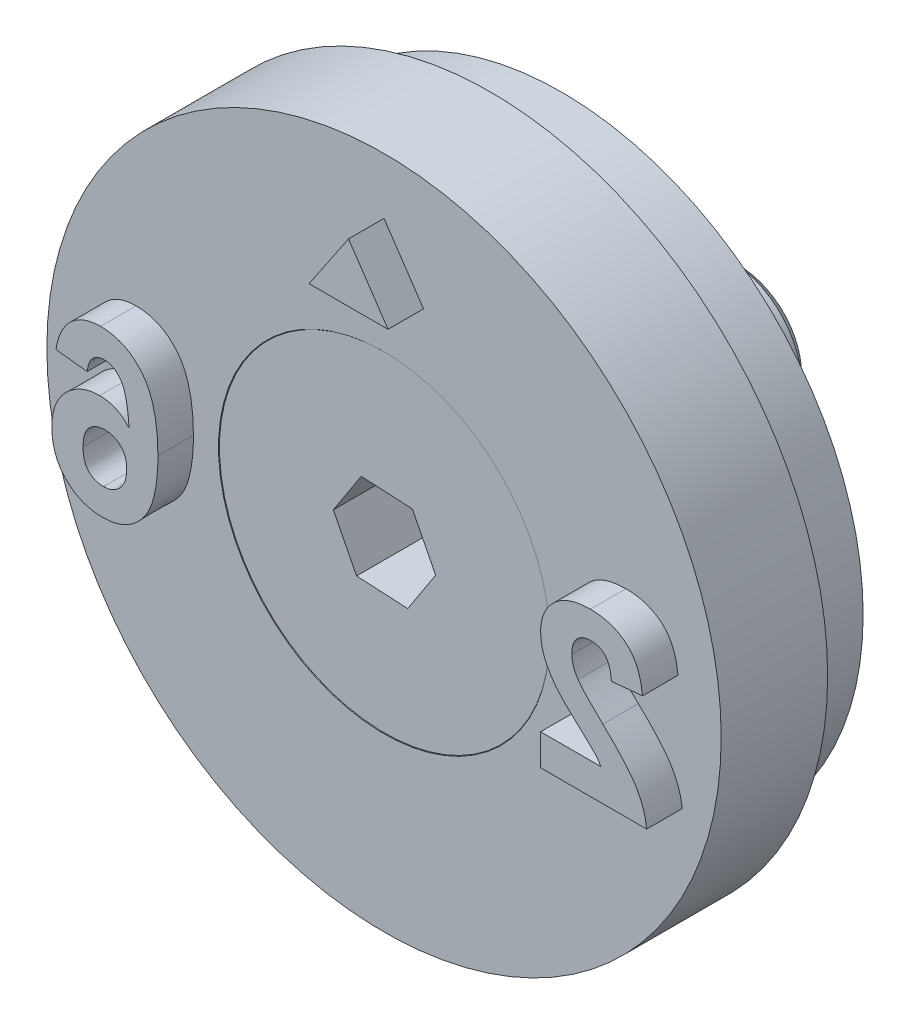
ISO-10303-21;
HEADER;
FILE_DESCRIPTION(('STEP AP214'),'2;1');
FILE_NAME('part.step','',(''),(''),'','','');
FILE_SCHEMA(('AUTOMOTIVE_DESIGN { 1 0 10303 214 1 1 1 1 }'));
ENDSEC;
DATA;
#1=APPLICATION_CONTEXT('core data for automotive mechanical design processes');
#2=APPLICATION_PROTOCOL_DEFINITION('international standard','automotive_design',2000,#1);
#3=PRODUCT_CONTEXT('',#1,'mechanical');
#4=PRODUCT('Part','Part','',(#3));
#5=PRODUCT_RELATED_PRODUCT_CATEGORY('part','',(#4));
#6=PRODUCT_DEFINITION_FORMATION('','',#4);
#7=PRODUCT_DEFINITION_CONTEXT('part definition',#1,'design');
#8=PRODUCT_DEFINITION('design','',#6,#7);
#9=PRODUCT_DEFINITION_SHAPE('','',#8);
#10=(LENGTH_UNIT() NAMED_UNIT(*) SI_UNIT(.MILLI.,.METRE.));
#11=(NAMED_UNIT(*) PLANE_ANGLE_UNIT() SI_UNIT($,.RADIAN.));
#12=(NAMED_UNIT(*) SI_UNIT($,.STERADIAN.) SOLID_ANGLE_UNIT());
#13=UNCERTAINTY_MEASURE_WITH_UNIT(LENGTH_MEASURE(1.E-05),#10,'distance_accuracy_value','');
#14=(GEOMETRIC_REPRESENTATION_CONTEXT(3) GLOBAL_UNCERTAINTY_ASSIGNED_CONTEXT((#13)) GLOBAL_UNIT_ASSIGNED_CONTEXT((#10,
#11,#12)) REPRESENTATION_CONTEXT('',''));
#15=CARTESIAN_POINT('',(0.,0.,0.));
#16=DIRECTION('',(0.,0.,1.));
#17=DIRECTION('',(1.,0.,0.));
#18=AXIS2_PLACEMENT_3D('',#15,#16,#17);
#19=CARTESIAN_POINT('',(0.,0.,-0.0130000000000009));
#20=DIRECTION('',(0.,0.,1.));
#21=DIRECTION('',(1.,0.,0.));
#22=AXIS2_PLACEMENT_3D('',#19,#20,#21);
#23=CYLINDRICAL_SURFACE('',#22,2.);
#24=CARTESIAN_POINT('',(0.,0.,-2.663));
#25=DIRECTION('',(0.,0.,1.));
#26=DIRECTION('',(1.,0.,0.));
#27=AXIS2_PLACEMENT_3D('',#24,#25,#26);
#28=CIRCLE('',#27,2.);
#29=CARTESIAN_POINT('',(2.,0.,-2.663));
#30=VERTEX_POINT('',#29);
#31=EDGE_CURVE('E12',#30,#30,#28,.T.);
#32=ORIENTED_EDGE('',*,*,#31,.F.);
#33=EDGE_LOOP('',(#32));
#34=FACE_BOUND('',#33,.T.);
#35=CARTESIAN_POINT('',(0.,0.,-9.763));
#36=DIRECTION('',(0.,0.,1.));
#37=DIRECTION('',(1.,0.,0.));
#38=AXIS2_PLACEMENT_3D('',#35,#36,#37);
#39=CIRCLE('',#38,2.);
#40=CARTESIAN_POINT('',(2.,0.,-9.763));
#41=VERTEX_POINT('',#40);
#42=EDGE_CURVE('E150',#41,#41,#39,.T.);
#43=ORIENTED_EDGE('',*,*,#42,.T.);
#44=EDGE_LOOP('',(#43));
#45=FACE_BOUND('',#44,.T.);
#46=ADVANCED_FACE('F49',(#34,#45),#23,.T.);
#47=CARTESIAN_POINT('',(0.,0.,-2.663));
#48=DIRECTION('',(0.,0.,1.));
#49=DIRECTION('',(1.,0.,0.));
#50=AXIS2_PLACEMENT_3D('',#47,#48,#49);
#51=CONICAL_SURFACE('',#50,2.,0.785398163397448);
#52=CARTESIAN_POINT('',(0.,0.,-0.0130000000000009));
#53=DIRECTION('',(0.,0.,1.));
#54=DIRECTION('',(1.,0.,0.));
#55=AXIS2_PLACEMENT_3D('',#52,#53,#54);
#56=CIRCLE('',#55,4.65);
#57=CARTESIAN_POINT('',(4.65,0.,-0.0130000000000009));
#58=VERTEX_POINT('',#57);
#59=EDGE_CURVE('E56',#58,#58,#56,.T.);
#60=ORIENTED_EDGE('',*,*,#59,.F.);
#61=EDGE_LOOP('',(#60));
#62=FACE_BOUND('',#61,.T.);
#63=ORIENTED_EDGE('',*,*,#31,.T.);
#64=EDGE_LOOP('',(#63));
#65=FACE_BOUND('',#64,.T.);
#66=ADVANCED_FACE('F165',(#62,#65),#51,.T.);
#67=CARTESIAN_POINT('',(0.,4.65,-0.0130000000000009));
#68=DIRECTION('',(0.,0.,-1.));
#69=DIRECTION('',(-1.,0.,0.));
#70=AXIS2_PLACEMENT_3D('',#67,#68,#69);
#71=PLANE('',#70);
#72=DIRECTION('',(0.99860351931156,-0.0528300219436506,0.));
#73=VECTOR('',#72,1.);
#74=CARTESIAN_POINT('',(-0.786717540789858,-1.21012761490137,-0.0130000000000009));
#75=LINE('',#74,#73);
#76=CARTESIAN_POINT('',(-0.786717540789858,-1.21012761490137,-0.0130000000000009));
#77=VERTEX_POINT('',#76);
#78=CARTESIAN_POINT('',(0.654642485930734,-1.28638118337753,-0.0130000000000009));
#79=VERTEX_POINT('',#78);
#80=EDGE_CURVE('E137',#77,#79,#75,.T.);
#81=ORIENTED_EDGE('',*,*,#80,.F.);
#82=DIRECTION('',(0.453549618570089,-0.891231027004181,0.));
#83=VECTOR('',#82,1.);
#84=CARTESIAN_POINT('',(-1.44136002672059,0.0762535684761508,-0.0130000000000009));
#85=LINE('',#84,#83);
#86=CARTESIAN_POINT('',(-1.44136002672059,0.0762535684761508,-0.0130000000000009));
#87=VERTEX_POINT('',#86);
#88=EDGE_CURVE('E63',#87,#77,#85,.T.);
#89=ORIENTED_EDGE('',*,*,#88,.F.);
#90=DIRECTION('',(-0.545053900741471,-0.83840100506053,0.));
#91=VECTOR('',#90,1.);
#92=CARTESIAN_POINT('',(-0.654642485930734,1.28638118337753,-0.0130000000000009));
#93=LINE('',#92,#91);
#94=CARTESIAN_POINT('',(-0.654642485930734,1.28638118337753,-0.0130000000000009));
#95=VERTEX_POINT('',#94);
#96=EDGE_CURVE('E146',#95,#87,#93,.T.);
#97=ORIENTED_EDGE('',*,*,#96,.F.);
#98=DIRECTION('',(-0.99860351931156,0.0528300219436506,0.));
#99=VECTOR('',#98,1.);
#100=CARTESIAN_POINT('',(0.786717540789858,1.21012761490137,-0.0130000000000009));
#101=LINE('',#100,#99);
#102=CARTESIAN_POINT('',(0.786717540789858,1.21012761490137,-0.0130000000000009));
#103=VERTEX_POINT('',#102);
#104=EDGE_CURVE('E144',#103,#95,#101,.T.);
#105=ORIENTED_EDGE('',*,*,#104,.F.);
#106=DIRECTION('',(-0.45354961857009,0.891231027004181,0.));
#107=VECTOR('',#106,1.);
#108=CARTESIAN_POINT('',(1.44136002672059,-0.0762535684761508,-0.0130000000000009));
#109=LINE('',#108,#107);
#110=CARTESIAN_POINT('',(1.44136002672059,-0.0762535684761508,-0.0130000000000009));
#111=VERTEX_POINT('',#110);
#112=EDGE_CURVE('E111',#111,#103,#109,.T.);
#113=ORIENTED_EDGE('',*,*,#112,.F.);
#114=DIRECTION('',(0.545053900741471,0.83840100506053,0.));
#115=VECTOR('',#114,1.);
#116=CARTESIAN_POINT('',(0.654642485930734,-1.28638118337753,-0.0130000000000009));
#117=LINE('',#116,#115);
#118=EDGE_CURVE('E140',#79,#111,#117,.T.);
#119=ORIENTED_EDGE('',*,*,#118,.F.);
#120=EDGE_LOOP('',(#81,#89,#97,#105,#113,#119));
#121=FACE_BOUND('',#120,.T.);
#122=ORIENTED_EDGE('',*,*,#59,.T.);
#123=EDGE_LOOP('',(#122));
#124=FACE_BOUND('',#123,.T.);
#125=ADVANCED_FACE('F163',(#121,#124),#71,.F.);
#126=CARTESIAN_POINT('',(0.,0.,-10.013));
#127=DIRECTION('',(0.,0.,1.));
#128=DIRECTION('',(1.,0.,0.));
#129=AXIS2_PLACEMENT_3D('',#126,#127,#128);
#130=PLANE('',#129);
#131=CARTESIAN_POINT('',(0.,0.,-10.013));
#132=DIRECTION('',(0.,0.,1.));
#133=DIRECTION('',(1.,0.,0.));
#134=AXIS2_PLACEMENT_3D('',#131,#132,#133);
#135=CIRCLE('',#134,1.75);
#136=CARTESIAN_POINT('',(1.75,0.,-10.013));
#137=VERTEX_POINT('',#136);
#138=EDGE_CURVE('E158',#137,#137,#135,.T.);
#139=ORIENTED_EDGE('',*,*,#138,.F.);
#140=EDGE_LOOP('',(#139));
#141=FACE_BOUND('',#140,.T.);
#142=ADVANCED_FACE('F178',(#141),#130,.F.);
#143=CARTESIAN_POINT('',(0.,0.,-10.013));
#144=DIRECTION('',(0.,0.,1.));
#145=DIRECTION('',(1.,0.,0.));
#146=AXIS2_PLACEMENT_3D('',#143,#144,#145);
#147=CONICAL_SURFACE('',#146,1.75,0.78539816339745);
#148=ORIENTED_EDGE('',*,*,#42,.F.);
#149=EDGE_LOOP('',(#148));
#150=FACE_BOUND('',#149,.T.);
#151=ORIENTED_EDGE('',*,*,#138,.T.);
#152=EDGE_LOOP('',(#151));
#153=FACE_BOUND('',#152,.T.);
#154=ADVANCED_FACE('F174',(#150,#153),#147,.T.);
#155=CARTESIAN_POINT('',(-1.44136002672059,0.0762535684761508,-2.013));
#156=DIRECTION('',(-0.891231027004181,-0.453549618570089,0.));
#157=DIRECTION('',(0.453549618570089,-0.891231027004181,0.));
#158=AXIS2_PLACEMENT_3D('',#155,#156,#157);
#159=PLANE('',#158);
#160=ORIENTED_EDGE('',*,*,#88,.T.);
#161=DIRECTION('',(0.,0.,1.));
#162=VECTOR('',#161,1.);
#163=CARTESIAN_POINT('',(-0.786717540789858,-1.21012761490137,-2.013));
#164=LINE('',#163,#162);
#165=CARTESIAN_POINT('',(-0.786717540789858,-1.21012761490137,-2.013));
#166=VERTEX_POINT('',#165);
#167=EDGE_CURVE('E93',#166,#77,#164,.T.);
#168=ORIENTED_EDGE('',*,*,#167,.F.);
#169=DIRECTION('',(0.453549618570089,-0.891231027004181,0.));
#170=VECTOR('',#169,1.);
#171=CARTESIAN_POINT('',(-1.44136002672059,0.0762535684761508,-2.013));
#172=LINE('',#171,#170);
#173=CARTESIAN_POINT('',(-1.44136002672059,0.0762535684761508,-2.013));
#174=VERTEX_POINT('',#173);
#175=EDGE_CURVE('E148',#174,#166,#172,.T.);
#176=ORIENTED_EDGE('',*,*,#175,.F.);
#177=DIRECTION('',(0.,0.,1.));
#178=VECTOR('',#177,1.);
#179=CARTESIAN_POINT('',(-1.44136002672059,0.0762535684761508,-2.013));
#180=LINE('',#179,#178);
#181=EDGE_CURVE('E71',#174,#87,#180,.T.);
#182=ORIENTED_EDGE('',*,*,#181,.T.);
#183=EDGE_LOOP('',(#160,#168,#176,#182));
#184=FACE_BOUND('',#183,.T.);
#185=ADVANCED_FACE('F177',(#184),#159,.F.);
#186=CARTESIAN_POINT('',(-0.654642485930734,1.28638118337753,-2.013));
#187=DIRECTION('',(-0.83840100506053,0.545053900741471,0.));
#188=DIRECTION('',(-0.54505390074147,-0.83840100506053,0.));
#189=AXIS2_PLACEMENT_3D('',#186,#187,#188);
#190=PLANE('',#189);
#191=ORIENTED_EDGE('',*,*,#96,.T.);
#192=ORIENTED_EDGE('',*,*,#181,.F.);
#193=DIRECTION('',(-0.545053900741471,-0.83840100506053,0.));
#194=VECTOR('',#193,1.);
#195=CARTESIAN_POINT('',(-0.654642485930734,1.28638118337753,-2.013));
#196=LINE('',#195,#194);
#197=CARTESIAN_POINT('',(-0.654642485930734,1.28638118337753,-2.013));
#198=VERTEX_POINT('',#197);
#199=EDGE_CURVE('E123',#198,#174,#196,.T.);
#200=ORIENTED_EDGE('',*,*,#199,.F.);
#201=DIRECTION('',(0.,0.,1.));
#202=VECTOR('',#201,1.);
#203=CARTESIAN_POINT('',(-0.654642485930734,1.28638118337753,-2.013));
#204=LINE('',#203,#202);
#205=EDGE_CURVE('E115',#198,#95,#204,.T.);
#206=ORIENTED_EDGE('',*,*,#205,.T.);
#207=EDGE_LOOP('',(#191,#192,#200,#206));
#208=FACE_BOUND('',#207,.T.);
#209=ADVANCED_FACE('F192',(#208),#190,.F.);
#210=CARTESIAN_POINT('',(0.786717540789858,1.21012761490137,-2.013));
#211=DIRECTION('',(0.0528300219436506,0.99860351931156,0.));
#212=DIRECTION('',(-0.99860351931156,0.0528300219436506,0.));
#213=AXIS2_PLACEMENT_3D('',#210,#211,#212);
#214=PLANE('',#213);
#215=ORIENTED_EDGE('',*,*,#104,.T.);
#216=ORIENTED_EDGE('',*,*,#205,.F.);
#217=DIRECTION('',(-0.99860351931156,0.0528300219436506,0.));
#218=VECTOR('',#217,1.);
#219=CARTESIAN_POINT('',(0.786717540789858,1.21012761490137,-2.013));
#220=LINE('',#219,#218);
#221=CARTESIAN_POINT('',(0.786717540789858,1.21012761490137,-2.013));
#222=VERTEX_POINT('',#221);
#223=EDGE_CURVE('E119',#222,#198,#220,.T.);
#224=ORIENTED_EDGE('',*,*,#223,.F.);
#225=DIRECTION('',(0.,0.,1.));
#226=VECTOR('',#225,1.);
#227=CARTESIAN_POINT('',(0.786717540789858,1.21012761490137,-2.013));
#228=LINE('',#227,#226);
#229=EDGE_CURVE('E104',#222,#103,#228,.T.);
#230=ORIENTED_EDGE('',*,*,#229,.T.);
#231=EDGE_LOOP('',(#215,#216,#224,#230));
#232=FACE_BOUND('',#231,.T.);
#233=ADVANCED_FACE('F120',(#232),#214,.F.);
#234=CARTESIAN_POINT('',(1.44136002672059,-0.0762535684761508,-2.013));
#235=DIRECTION('',(0.89123102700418,0.45354961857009,0.));
#236=DIRECTION('',(-0.45354961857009,0.891231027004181,0.));
#237=AXIS2_PLACEMENT_3D('',#234,#235,#236);
#238=PLANE('',#237);
#239=ORIENTED_EDGE('',*,*,#112,.T.);
#240=ORIENTED_EDGE('',*,*,#229,.F.);
#241=DIRECTION('',(-0.45354961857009,0.891231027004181,0.));
#242=VECTOR('',#241,1.);
#243=CARTESIAN_POINT('',(1.44136002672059,-0.0762535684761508,-2.013));
#244=LINE('',#243,#242);
#245=CARTESIAN_POINT('',(1.44136002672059,-0.0762535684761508,-2.013));
#246=VERTEX_POINT('',#245);
#247=EDGE_CURVE('E108',#246,#222,#244,.T.);
#248=ORIENTED_EDGE('',*,*,#247,.F.);
#249=DIRECTION('',(0.,0.,1.));
#250=VECTOR('',#249,1.);
#251=CARTESIAN_POINT('',(1.44136002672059,-0.0762535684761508,-2.013));
#252=LINE('',#251,#250);
#253=EDGE_CURVE('E116',#246,#111,#252,.T.);
#254=ORIENTED_EDGE('',*,*,#253,.T.);
#255=EDGE_LOOP('',(#239,#240,#248,#254));
#256=FACE_BOUND('',#255,.T.);
#257=ADVANCED_FACE('F106',(#256),#238,.F.);
#258=CARTESIAN_POINT('',(0.654642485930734,-1.28638118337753,-2.013));
#259=DIRECTION('',(0.83840100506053,-0.545053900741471,0.));
#260=DIRECTION('',(0.54505390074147,0.83840100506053,0.));
#261=AXIS2_PLACEMENT_3D('',#258,#259,#260);
#262=PLANE('',#261);
#263=ORIENTED_EDGE('',*,*,#118,.T.);
#264=ORIENTED_EDGE('',*,*,#253,.F.);
#265=DIRECTION('',(0.545053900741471,0.83840100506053,0.));
#266=VECTOR('',#265,1.);
#267=CARTESIAN_POINT('',(0.654642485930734,-1.28638118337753,-2.013));
#268=LINE('',#267,#266);
#269=CARTESIAN_POINT('',(0.654642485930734,-1.28638118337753,-2.013));
#270=VERTEX_POINT('',#269);
#271=EDGE_CURVE('E129',#270,#246,#268,.T.);
#272=ORIENTED_EDGE('',*,*,#271,.F.);
#273=DIRECTION('',(0.,0.,1.));
#274=VECTOR('',#273,1.);
#275=CARTESIAN_POINT('',(0.654642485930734,-1.28638118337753,-2.013));
#276=LINE('',#275,#274);
#277=EDGE_CURVE('E153',#270,#79,#276,.T.);
#278=ORIENTED_EDGE('',*,*,#277,.T.);
#279=EDGE_LOOP('',(#263,#264,#272,#278));
#280=FACE_BOUND('',#279,.T.);
#281=ADVANCED_FACE('F196',(#280),#262,.F.);
#282=CARTESIAN_POINT('',(-0.786717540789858,-1.21012761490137,-2.013));
#283=DIRECTION('',(-0.0528300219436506,-0.99860351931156,0.));
#284=DIRECTION('',(0.99860351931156,-0.0528300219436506,0.));
#285=AXIS2_PLACEMENT_3D('',#282,#283,#284);
#286=PLANE('',#285);
#287=ORIENTED_EDGE('',*,*,#80,.T.);
#288=ORIENTED_EDGE('',*,*,#277,.F.);
#289=DIRECTION('',(0.99860351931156,-0.0528300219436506,0.));
#290=VECTOR('',#289,1.);
#291=CARTESIAN_POINT('',(-0.786717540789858,-1.21012761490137,-2.013));
#292=LINE('',#291,#290);
#293=EDGE_CURVE('E131',#166,#270,#292,.T.);
#294=ORIENTED_EDGE('',*,*,#293,.F.);
#295=ORIENTED_EDGE('',*,*,#167,.T.);
#296=EDGE_LOOP('',(#287,#288,#294,#295));
#297=FACE_BOUND('',#296,.T.);
#298=ADVANCED_FACE('F193',(#297),#286,.F.);
#299=CARTESIAN_POINT('',(0.,0.,-2.013));
#300=DIRECTION('',(0.,0.,1.));
#301=DIRECTION('',(1.,0.,0.));
#302=AXIS2_PLACEMENT_3D('',#299,#300,#301);
#303=PLANE('',#302);
#304=ORIENTED_EDGE('',*,*,#175,.T.);
#305=ORIENTED_EDGE('',*,*,#293,.T.);
#306=ORIENTED_EDGE('',*,*,#271,.T.);
#307=ORIENTED_EDGE('',*,*,#247,.T.);
#308=ORIENTED_EDGE('',*,*,#223,.T.);
#309=ORIENTED_EDGE('',*,*,#199,.T.);
#310=EDGE_LOOP('',(#304,#305,#306,#307,#308,#309));
#311=FACE_BOUND('',#310,.T.);
#312=ADVANCED_FACE('F126',(#311),#303,.T.);
#313=CLOSED_SHELL('',(#46,#66,#125,#142,#154,#185,#209,#233,#257,#281,#298,#312));
#314=MANIFOLD_SOLID_BREP('B2',#313);
#315=CARTESIAN_POINT('',(0.,9.5,0.));
#316=DIRECTION('',(0.,0.,-1.));
#317=DIRECTION('',(-1.,0.,0.));
#318=AXIS2_PLACEMENT_3D('',#315,#316,#317);
#319=PLANE('',#318);
#320=CARTESIAN_POINT('',(-6.987912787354,2.286,0.));
#321=CARTESIAN_POINT('',(-7.02917630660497,2.2852576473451,0.));
#322=CARTESIAN_POINT('',(-7.10984121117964,2.28380644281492,0.));
#323=CARTESIAN_POINT('',(-7.22806723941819,2.26839586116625,0.));
#324=CARTESIAN_POINT('',(-7.3408537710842,2.24483058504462,0.));
#325=CARTESIAN_POINT('',(-7.44849641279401,2.21221077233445,0.));
#326=CARTESIAN_POINT('',(-7.5502372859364,2.16852653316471,0.));
#327=CARTESIAN_POINT('',(-7.64648040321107,2.11530901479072,0.));
#328=CARTESIAN_POINT('',(-7.73754931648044,2.0527023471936,0.));
#329=CARTESIAN_POINT('',(-7.82297018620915,1.98110961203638,0.));
#330=CARTESIAN_POINT('',(-7.90205551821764,1.90031413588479,0.));
#331=CARTESIAN_POINT('',(-7.97346774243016,1.81013311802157,0.));
#332=CARTESIAN_POINT('',(-8.0376797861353,1.71165492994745,0.));
#333=CARTESIAN_POINT('',(-8.09497267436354,1.60496129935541,0.));
#334=CARTESIAN_POINT('',(-8.14302900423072,1.48903036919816,0.));
#335=CARTESIAN_POINT('',(-8.18434135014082,1.36477379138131,0.));
#336=CARTESIAN_POINT('',(-8.21831788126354,1.23192461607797,0.));
#337=CARTESIAN_POINT('',(-8.23441454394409,1.13976778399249,0.));
#338=CARTESIAN_POINT('',(-8.24264836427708,1.09262740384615,0.));
#339=B_SPLINE_CURVE_WITH_KNOTS('',3,(#320,#321,#322,#323,#324,#325,#326,#327,#328,#329,#330,
#331,#332,#333,#334,#335,#336,#337,#338),.UNSPECIFIED.,.F.,.F.,(4,1,1,1,1,1,1,1,1,1,1,1,1,1,1,1,
4),(0.,0.0647517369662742,0.126581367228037,0.186839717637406,0.245514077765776,
0.302849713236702,0.360345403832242,0.417912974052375,0.476091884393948,0.535068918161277,
0.595103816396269,0.656390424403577,0.719434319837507,0.784953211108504,0.853160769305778,
0.924888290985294,1.),.UNSPECIFIED.);
#340=CARTESIAN_POINT('',(-6.987912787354,2.286,0.));
#341=VERTEX_POINT('',#340);
#342=CARTESIAN_POINT('',(-8.24264836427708,1.09262740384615,0.));
#343=VERTEX_POINT('',#342);
#344=EDGE_CURVE('E574',#341,#343,#339,.T.);
#345=ORIENTED_EDGE('',*,*,#344,.F.);
#346=CARTESIAN_POINT('',(-5.37049451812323,-0.0613629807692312,0.));
#347=CARTESIAN_POINT('',(-5.37186148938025,0.038812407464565,0.));
#348=CARTESIAN_POINT('',(-5.37450280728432,0.232375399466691,0.));
#349=CARTESIAN_POINT('',(-5.39575724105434,0.511853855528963,0.));
#350=CARTESIAN_POINT('',(-5.42951803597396,0.769940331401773,0.));
#351=CARTESIAN_POINT('',(-5.47869909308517,1.00605282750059,0.));
#352=CARTESIAN_POINT('',(-5.54160546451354,1.22068125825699,0.));
#353=CARTESIAN_POINT('',(-5.61786927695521,1.41425694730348,0.));
#354=CARTESIAN_POINT('',(-5.70940651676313,1.58607909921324,0.));
#355=CARTESIAN_POINT('',(-5.81583288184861,1.73558892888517,0.));
#356=CARTESIAN_POINT('',(-5.9329325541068,1.86555232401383,0.));
#357=CARTESIAN_POINT('',(-6.05875666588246,1.97773279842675,0.));
#358=CARTESIAN_POINT('',(-6.19282486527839,2.07321510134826,0.));
#359=CARTESIAN_POINT('',(-6.33513393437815,2.151758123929,0.));
#360=CARTESIAN_POINT('',(-6.48685211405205,2.21130114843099,0.));
#361=CARTESIAN_POINT('',(-6.64654031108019,2.2542986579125,0.));
#362=CARTESIAN_POINT('',(-6.81446674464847,2.28193247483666,0.));
#363=CARTESIAN_POINT('',(-6.9294936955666,2.28462999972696,0.));
#364=CARTESIAN_POINT('',(-6.987912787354,2.286,0.));
#365=B_SPLINE_CURVE_WITH_KNOTS('',3,(#346,#347,#348,#349,#350,#351,#352,#353,#354,#355,#356,
#357,#358,#359,#360,#361,#362,#363,#364),.UNSPECIFIED.,.F.,.F.,(4,1,1,1,1,1,1,1,1,1,1,1,1,1,1,1,
4),(0.,0.0932311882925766,0.180145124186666,0.260720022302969,0.335343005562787,
0.40439372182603,0.46866345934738,0.528671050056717,0.585123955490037,0.639046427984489,
0.691174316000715,0.741714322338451,0.791946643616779,0.842075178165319,0.893016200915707,
0.945665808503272,1.),.UNSPECIFIED.);
#366=CARTESIAN_POINT('',(-5.37049451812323,-0.0613629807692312,0.));
#367=VERTEX_POINT('',#366);
#368=EDGE_CURVE('E634',#367,#341,#365,.T.);
#369=ORIENTED_EDGE('',*,*,#368,.F.);
#370=CARTESIAN_POINT('',(-6.92197047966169,-2.34461538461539,0.));
#371=CARTESIAN_POINT('',(-6.86662352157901,-2.34306693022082,0.));
#372=CARTESIAN_POINT('',(-6.75780155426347,-2.34002239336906,0.));
#373=CARTESIAN_POINT('',(-6.59849828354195,-2.31496739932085,0.));
#374=CARTESIAN_POINT('',(-6.44704629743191,-2.2725783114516,0.));
#375=CARTESIAN_POINT('',(-6.30346441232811,-2.21338014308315,0.));
#376=CARTESIAN_POINT('',(-6.16655922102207,-2.13891801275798,0.));
#377=CARTESIAN_POINT('',(-6.03760198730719,-2.04642247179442,0.));
#378=CARTESIAN_POINT('',(-5.91693444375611,-1.93677557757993,0.));
#379=CARTESIAN_POINT('',(-5.80296057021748,-1.81146220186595,0.));
#380=CARTESIAN_POINT('',(-5.69924739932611,-1.66671535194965,0.));
#381=CARTESIAN_POINT('',(-5.61092437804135,-1.49941843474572,0.));
#382=CARTESIAN_POINT('',(-5.53601760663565,-1.3114036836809,0.));
#383=CARTESIAN_POINT('',(-5.47503251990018,-1.10218891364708,0.));
#384=CARTESIAN_POINT('',(-5.42795643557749,-0.871790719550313,0.));
#385=CARTESIAN_POINT('',(-5.39510781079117,-0.620189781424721,0.));
#386=CARTESIAN_POINT('',(-5.37328946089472,-0.347802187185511,0.));
#387=CARTESIAN_POINT('',(-5.3714482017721,-0.159101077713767,0.));
#388=CARTESIAN_POINT('',(-5.37049451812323,-0.0613629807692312,0.));
#389=B_SPLINE_CURVE_WITH_KNOTS('',3,(#370,#371,#372,#373,#374,#375,#376,#377,#378,#379,#380,
#381,#382,#383,#384,#385,#386,#387,#388),.UNSPECIFIED.,.F.,.F.,(4,1,1,1,1,1,1,1,1,1,1,1,1,1,1,1,
4),(0.,0.0532594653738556,0.104717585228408,0.154775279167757,0.204330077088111,
0.25391362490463,0.30447604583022,0.356706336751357,0.410596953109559,0.467274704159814,
0.52762561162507,0.59224090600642,0.661798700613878,0.737130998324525,0.818387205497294,
0.905933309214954,1.),.UNSPECIFIED.);
#390=CARTESIAN_POINT('',(-6.92197047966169,-2.34461538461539,0.));
#391=VERTEX_POINT('',#390);
#392=EDGE_CURVE('E626',#391,#367,#389,.T.);
#393=ORIENTED_EDGE('',*,*,#392,.F.);
#394=CARTESIAN_POINT('',(-8.35987913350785,-0.853586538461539,0.));
#395=CARTESIAN_POINT('',(-8.35861003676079,-0.90858476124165,0.));
#396=CARTESIAN_POINT('',(-8.3561349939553,-1.01584447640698,0.));
#397=CARTESIAN_POINT('',(-8.33791694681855,-1.17292886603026,0.));
#398=CARTESIAN_POINT('',(-8.30573613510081,-1.32119884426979,0.));
#399=CARTESIAN_POINT('',(-8.26177019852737,-1.46184398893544,0.));
#400=CARTESIAN_POINT('',(-8.20490153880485,-1.59374983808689,0.));
#401=CARTESIAN_POINT('',(-8.13600977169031,-1.71800343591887,0.));
#402=CARTESIAN_POINT('',(-8.05276354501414,-1.83248138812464,0.));
#403=CARTESIAN_POINT('',(-7.95894076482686,-1.93872358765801,0.));
#404=CARTESIAN_POINT('',(-7.85434693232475,-2.03353099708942,0.));
#405=CARTESIAN_POINT('',(-7.74287960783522,-2.11748407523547,0.));
#406=CARTESIAN_POINT('',(-7.62330245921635,-2.18727181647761,0.));
#407=CARTESIAN_POINT('',(-7.49738298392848,-2.24601015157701,0.));
#408=CARTESIAN_POINT('',(-7.36295842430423,-2.28911638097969,0.));
#409=CARTESIAN_POINT('',(-7.2223986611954,-2.32144388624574,0.));
#410=CARTESIAN_POINT('',(-7.07456076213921,-2.34116077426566,0.));
#411=CARTESIAN_POINT('',(-6.97362513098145,-2.34344593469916,0.));
#412=CARTESIAN_POINT('',(-6.92197047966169,-2.34461538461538,0.));
#413=B_SPLINE_CURVE_WITH_KNOTS('',3,(#394,#395,#396,#397,#398,#399,#400,#401,#402,#403,#404,
#405,#406,#407,#408,#409,#410,#411,#412),.UNSPECIFIED.,.F.,.F.,(4,1,1,1,1,1,1,1,1,1,1,1,1,1,1,1,
4),(0.,0.0708046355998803,0.13808600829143,0.203231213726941,0.265884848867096,
0.327509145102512,0.387868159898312,0.448411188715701,0.509386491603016,0.570040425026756,
0.629864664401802,0.68871511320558,0.747985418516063,0.80839432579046,0.870086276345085,
0.933515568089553,1.),.UNSPECIFIED.);
#414=CARTESIAN_POINT('',(-8.35987913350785,-0.853586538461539,0.));
#415=VERTEX_POINT('',#414);
#416=EDGE_CURVE('E618',#415,#391,#413,.T.);
#417=ORIENTED_EDGE('',*,*,#416,.F.);
#418=CARTESIAN_POINT('',(-7.00897769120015,0.586153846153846,0.));
#419=CARTESIAN_POINT('',(-7.05451811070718,0.584842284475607,0.));
#420=CARTESIAN_POINT('',(-7.14444426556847,0.582252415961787,0.));
#421=CARTESIAN_POINT('',(-7.2769263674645,0.564087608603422,0.));
#422=CARTESIAN_POINT('',(-7.40405164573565,0.531424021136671,0.));
#423=CARTESIAN_POINT('',(-7.52639519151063,0.48723842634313,0.));
#424=CARTESIAN_POINT('',(-7.64456168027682,0.431597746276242,0.));
#425=CARTESIAN_POINT('',(-7.75629071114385,0.361164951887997,0.));
#426=CARTESIAN_POINT('',(-7.86333613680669,0.279043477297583,0.));
#427=CARTESIAN_POINT('',(-7.96422576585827,0.185220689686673,0.));
#428=CARTESIAN_POINT('',(-8.05691907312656,0.0819296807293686,0.));
#429=CARTESIAN_POINT('',(-8.13875809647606,-0.0296327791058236,0.));
#430=CARTESIAN_POINT('',(-8.20610892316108,-0.149807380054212,0.));
#431=CARTESIAN_POINT('',(-8.26368581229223,-0.275903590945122,0.));
#432=CARTESIAN_POINT('',(-8.30652521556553,-0.410410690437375,0.));
#433=CARTESIAN_POINT('',(-8.33762209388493,-0.551393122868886,0.));
#434=CARTESIAN_POINT('',(-8.35618474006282,-0.700144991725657,0.));
#435=CARTESIAN_POINT('',(-8.35862829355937,-0.801634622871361,0.));
#436=CARTESIAN_POINT('',(-8.35987913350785,-0.853586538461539,0.));
#437=B_SPLINE_CURVE_WITH_KNOTS('',3,(#418,#419,#420,#421,#422,#423,#424,#425,#426,#427,#428,
#429,#430,#431,#432,#433,#434,#435,#436),.UNSPECIFIED.,.F.,.F.,(4,1,1,1,1,1,1,1,1,1,1,1,1,1,1,1,
4),(0.,0.0619593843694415,0.122347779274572,0.181484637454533,0.240217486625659,
0.299114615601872,0.358819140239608,0.419550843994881,0.482449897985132,0.545990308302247,
0.608137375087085,0.670271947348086,0.733113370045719,0.796428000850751,0.861936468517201,
0.9293261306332,1.),.UNSPECIFIED.);
#438=CARTESIAN_POINT('',(-7.00897769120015,0.586153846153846,0.));
#439=VERTEX_POINT('',#438);
#440=EDGE_CURVE('E610',#439,#415,#437,.T.);
#441=ORIENTED_EDGE('',*,*,#440,.F.);
#442=CARTESIAN_POINT('',(-6.18286711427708,0.203322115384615,0.));
#443=CARTESIAN_POINT('',(-6.21096744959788,0.233842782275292,0.));
#444=CARTESIAN_POINT('',(-6.26606925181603,0.29369060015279,0.));
#445=CARTESIAN_POINT('',(-6.35750053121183,0.371718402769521,0.));
#446=CARTESIAN_POINT('',(-6.45328840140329,0.438426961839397,0.));
#447=CARTESIAN_POINT('',(-6.55447517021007,0.493155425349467,0.));
#448=CARTESIAN_POINT('',(-6.66161315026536,0.533882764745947,0.));
#449=CARTESIAN_POINT('',(-6.77276162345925,0.564806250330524,0.));
#450=CARTESIAN_POINT('',(-6.88937552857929,0.582128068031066,0.));
#451=CARTESIAN_POINT('',(-6.96862584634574,0.584795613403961,0.));
#452=CARTESIAN_POINT('',(-7.00897769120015,0.586153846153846,0.));
#453=B_SPLINE_CURVE_WITH_KNOTS('',3,(#442,#443,#444,#445,#446,#447,#448,#449,#450,#451,#452),
.UNSPECIFIED.,.F.,.F.,(4,1,1,1,1,1,1,1,4),(0.,0.132218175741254,0.259265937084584,
0.38242622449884,0.503963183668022,0.625109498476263,0.747226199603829,0.871295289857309,1.),.UNSPECIFIED.);
#454=CARTESIAN_POINT('',(-6.18286711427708,0.203322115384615,0.));
#455=VERTEX_POINT('',#454);
#456=EDGE_CURVE('E602',#455,#439,#453,.T.);
#457=ORIENTED_EDGE('',*,*,#456,.F.);
#458=CARTESIAN_POINT('',(-6.87526134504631,1.524,0.));
#459=CARTESIAN_POINT('',(-6.85321043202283,1.52346080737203,0.));
#460=CARTESIAN_POINT('',(-6.80933022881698,1.52238784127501,0.));
#461=CARTESIAN_POINT('',(-6.74541338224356,1.50876543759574,0.));
#462=CARTESIAN_POINT('',(-6.68378985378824,1.48854970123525,0.));
#463=CARTESIAN_POINT('',(-6.62496257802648,1.45991837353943,0.));
#464=CARTESIAN_POINT('',(-6.56863803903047,1.42297495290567,0.));
#465=CARTESIAN_POINT('',(-6.51567250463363,1.37727786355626,0.));
#466=CARTESIAN_POINT('',(-6.46363092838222,1.32523590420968,0.));
#467=CARTESIAN_POINT('',(-6.41557643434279,1.26239279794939,0.));
#468=CARTESIAN_POINT('',(-6.36947373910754,1.18798215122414,0.));
#469=CARTESIAN_POINT('',(-6.32977745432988,1.09688948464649,0.));
#470=CARTESIAN_POINT('',(-6.29439612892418,0.989199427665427,0.));
#471=CARTESIAN_POINT('',(-6.26410214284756,0.864384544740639,0.));
#472=CARTESIAN_POINT('',(-6.23661066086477,0.723237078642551,0.));
#473=CARTESIAN_POINT('',(-6.21407545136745,0.565185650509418,0.));
#474=CARTESIAN_POINT('',(-6.19604290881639,0.390088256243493,0.));
#475=CARTESIAN_POINT('',(-6.18739199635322,0.267462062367,0.));
#476=CARTESIAN_POINT('',(-6.18286711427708,0.203322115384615,0.));
#477=B_SPLINE_CURVE_WITH_KNOTS('',3,(#458,#459,#460,#461,#462,#463,#464,#465,#466,#467,#468,
#469,#470,#471,#472,#473,#474,#475,#476),.UNSPECIFIED.,.F.,.F.,(4,1,1,1,1,1,1,1,1,1,1,1,1,1,1,1,
4),(0.,0.040153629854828,0.079903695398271,0.118642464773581,0.158240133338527,
0.198858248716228,0.241137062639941,0.285631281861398,0.332856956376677,0.385095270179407,
0.444912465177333,0.513585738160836,0.591645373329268,0.679009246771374,0.775790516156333,
0.882726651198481,1.),.UNSPECIFIED.);
#478=CARTESIAN_POINT('',(-6.87526134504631,1.524,0.));
#479=VERTEX_POINT('',#478);
#480=EDGE_CURVE('E594',#479,#455,#477,.T.);
#481=ORIENTED_EDGE('',*,*,#480,.F.);
#482=CARTESIAN_POINT('',(-7.36341759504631,0.996461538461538,0.));
#483=CARTESIAN_POINT('',(-7.35752703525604,1.03880918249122,0.));
#484=CARTESIAN_POINT('',(-7.34644207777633,1.11849971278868,0.));
#485=CARTESIAN_POINT('',(-7.31360900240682,1.22847259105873,0.));
#486=CARTESIAN_POINT('',(-7.26790164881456,1.32098784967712,0.));
#487=CARTESIAN_POINT('',(-7.2092318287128,1.39617484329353,0.));
#488=CARTESIAN_POINT('',(-7.13934989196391,1.45404187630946,0.));
#489=CARTESIAN_POINT('',(-7.05972319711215,1.49515993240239,0.));
#490=CARTESIAN_POINT('',(-6.97040235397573,1.51956861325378,0.));
#491=CARTESIAN_POINT('',(-6.90777868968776,1.52248543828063,0.));
#492=CARTESIAN_POINT('',(-6.87526134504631,1.524,0.));
#493=B_SPLINE_CURVE_WITH_KNOTS('',3,(#482,#483,#484,#485,#486,#487,#488,#489,#490,#491,#492),
.UNSPECIFIED.,.F.,.F.,(4,1,1,1,1,1,1,1,4),(0.,0.160089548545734,0.301259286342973,
0.428171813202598,0.544692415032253,0.656041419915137,0.765564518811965,0.878269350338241,1.),.UNSPECIFIED.);
#494=CARTESIAN_POINT('',(-7.36341759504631,0.996461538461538,0.));
#495=VERTEX_POINT('',#494);
#496=EDGE_CURVE('E589',#495,#479,#493,.T.);
#497=ORIENTED_EDGE('',*,*,#496,.F.);
#498=DIRECTION('',(0.994071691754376,-0.108726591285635,0.));
#499=VECTOR('',#498,1.);
#500=CARTESIAN_POINT('',(-8.24264836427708,1.09262740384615,0.));
#501=LINE('',#500,#499);
#502=EDGE_CURVE('E582',#343,#495,#501,.T.);
#503=ORIENTED_EDGE('',*,*,#502,.F.);
#504=EDGE_LOOP('',(#345,#369,#393,#417,#441,#457,#481,#497,#503));
#505=FACE_BOUND('',#504,.T.);
#506=CARTESIAN_POINT('',(0.,0.,0.));
#507=DIRECTION('',(0.,0.,1.));
#508=DIRECTION('',(1.,0.,0.));
#509=AXIS2_PLACEMENT_3D('',#506,#507,#508);
#510=CIRCLE('',#509,9.5);
#511=CARTESIAN_POINT('',(9.5,0.,0.));
#512=VERTEX_POINT('',#511);
#513=EDGE_CURVE('E47',#512,#512,#510,.T.);
#514=ORIENTED_EDGE('',*,*,#513,.T.);
#515=EDGE_LOOP('',(#514));
#516=FACE_BOUND('',#515,.T.);
#517=CARTESIAN_POINT('',(0.,0.,0.));
#518=DIRECTION('',(0.,0.,1.));
#519=DIRECTION('',(1.,0.,0.));
#520=AXIS2_PLACEMENT_3D('',#517,#518,#519);
#521=CIRCLE('',#520,4.663);
#522=CARTESIAN_POINT('',(4.663,0.,0.));
#523=VERTEX_POINT('',#522);
#524=EDGE_CURVE('E317',#523,#523,#521,.T.);
#525=ORIENTED_EDGE('',*,*,#524,.F.);
#526=EDGE_LOOP('',(#525));
#527=FACE_BOUND('',#526,.T.);
#528=DIRECTION('',(-1.,0.,0.));
#529=VECTOR('',#528,1.);
#530=CARTESIAN_POINT('',(7.11132192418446,-1.40676923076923,0.));
#531=LINE('',#530,#529);
#532=CARTESIAN_POINT('',(7.11132192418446,-1.40676923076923,0.));
#533=VERTEX_POINT('',#532);
#534=CARTESIAN_POINT('',(5.41239163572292,-1.40676923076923,0.));
#535=VERTEX_POINT('',#534);
#536=EDGE_CURVE('E672',#533,#535,#531,.T.);
#537=ORIENTED_EDGE('',*,*,#536,.F.);
#538=CARTESIAN_POINT('',(5.85567048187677,-0.104408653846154,0.));
#539=CARTESIAN_POINT('',(5.86957664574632,-0.121923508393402,0.));
#540=CARTESIAN_POINT('',(5.89936042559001,-0.159436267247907,0.));
#541=CARTESIAN_POINT('',(5.95003046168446,-0.216956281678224,0.));
#542=CARTESIAN_POINT('',(6.00875267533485,-0.279786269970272,0.));
#543=CARTESIAN_POINT('',(6.07469764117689,-0.349102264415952,0.));
#544=CARTESIAN_POINT('',(6.15004365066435,-0.422449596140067,0.));
#545=CARTESIAN_POINT('',(6.2320797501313,-0.502895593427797,0.));
#546=CARTESIAN_POINT('',(6.32441576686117,-0.586325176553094,0.));
#547=CARTESIAN_POINT('',(6.42005350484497,-0.674819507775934,0.));
#548=CARTESIAN_POINT('',(6.51610694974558,-0.760949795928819,0.));
#549=CARTESIAN_POINT('',(6.60439391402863,-0.842754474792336,0.));
#550=CARTESIAN_POINT('',(6.68458785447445,-0.915134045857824,0.));
#551=CARTESIAN_POINT('',(6.75295398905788,-0.98208419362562,0.));
#552=CARTESIAN_POINT('',(6.81351359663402,-1.03903561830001,0.));
#553=CARTESIAN_POINT('',(6.86408390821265,-1.08890872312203,0.));
#554=CARTESIAN_POINT('',(6.9056112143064,-1.13049612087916,0.));
#555=CARTESIAN_POINT('',(6.96283316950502,-1.19532032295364,0.));
#556=CARTESIAN_POINT('',(7.03564161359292,-1.28299508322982,0.));
#557=CARTESIAN_POINT('',(7.08686533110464,-1.36677079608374,0.));
#558=CARTESIAN_POINT('',(7.11132192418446,-1.40676923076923,0.));
#559=B_SPLINE_CURVE_WITH_KNOTS('',3,(#538,#539,#540,#541,#542,#543,#544,#545,#546,#547,#548,
#549,#550,#551,#552,#553,#554,#555,#556,#557,#558),.UNSPECIFIED.,.F.,.F.,(4,1,1,1,1,1,1,1,1,1,1,
1,1,1,1,1,1,1,4),(0.,0.0369753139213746,0.0791925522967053,0.126700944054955,0.179184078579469,
0.237368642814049,0.300558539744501,0.369153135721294,0.443112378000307,0.516018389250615,
0.582473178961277,0.642136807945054,0.694619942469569,0.740679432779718,0.779589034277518,
0.812073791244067,0.837814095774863,0.922564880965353,1.),.UNSPECIFIED.);
#560=CARTESIAN_POINT('',(5.85567048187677,-0.104408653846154,0.));
#561=VERTEX_POINT('',#560);
#562=EDGE_CURVE('E677',#561,#533,#559,.T.);
#563=ORIENTED_EDGE('',*,*,#562,.F.);
#564=CARTESIAN_POINT('',(5.41239163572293,1.04225480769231,0.));
#565=CARTESIAN_POINT('',(5.41351022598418,0.992417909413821,0.));
#566=CARTESIAN_POINT('',(5.41572933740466,0.893549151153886,0.));
#567=CARTESIAN_POINT('',(5.43697568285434,0.74739158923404,0.));
#568=CARTESIAN_POINT('',(5.46943596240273,0.604604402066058,0.));
#569=CARTESIAN_POINT('',(5.5174096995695,0.4648386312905,0.));
#570=CARTESIAN_POINT('',(5.57822013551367,0.324741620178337,0.));
#571=CARTESIAN_POINT('',(5.65660624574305,0.183998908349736,0.));
#572=CARTESIAN_POINT('',(5.74761844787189,0.0383659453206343,0.));
#573=CARTESIAN_POINT('',(5.81887741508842,-0.0557921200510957,0.));
#574=CARTESIAN_POINT('',(5.85567048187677,-0.104408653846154,0.));
#575=B_SPLINE_CURVE_WITH_KNOTS('',3,(#564,#565,#566,#567,#568,#569,#570,#571,#572,#573,#574),
.UNSPECIFIED.,.F.,.F.,(4,1,1,1,1,1,1,1,4),(0.,0.119176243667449,0.236427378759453,
0.352663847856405,0.469086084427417,0.589462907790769,0.717601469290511,0.854189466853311,1.),.UNSPECIFIED.);
#576=CARTESIAN_POINT('',(5.41239163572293,1.04225480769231,0.));
#577=VERTEX_POINT('',#576);
#578=EDGE_CURVE('E892',#577,#561,#575,.T.);
#579=ORIENTED_EDGE('',*,*,#578,.F.);
#580=CARTESIAN_POINT('',(6.81549740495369,2.286,0.));
#581=CARTESIAN_POINT('',(6.76233788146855,2.28497830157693,0.));
#582=CARTESIAN_POINT('',(6.65880303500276,2.28298841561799,0.));
#583=CARTESIAN_POINT('',(6.50766053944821,2.26655592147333,0.));
#584=CARTESIAN_POINT('',(6.36567302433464,2.23790348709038,0.));
#585=CARTESIAN_POINT('',(6.23159913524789,2.19994928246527,0.));
#586=CARTESIAN_POINT('',(6.10681573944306,2.14927764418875,0.));
#587=CARTESIAN_POINT('',(5.99028302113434,2.08801774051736,0.));
#588=CARTESIAN_POINT('',(5.8838350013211,2.01384463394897,0.));
#589=CARTESIAN_POINT('',(5.78588492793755,1.93080329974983,0.));
#590=CARTESIAN_POINT('',(5.69832539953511,1.8394847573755,0.));
#591=CARTESIAN_POINT('',(5.62163117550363,1.74207809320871,0.));
#592=CARTESIAN_POINT('',(5.55737700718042,1.63865117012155,0.));
#593=CARTESIAN_POINT('',(5.50345789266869,1.53046464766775,0.));
#594=CARTESIAN_POINT('',(5.46342331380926,1.41577764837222,0.));
#595=CARTESIAN_POINT('',(5.43425237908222,1.29617597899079,0.));
#596=CARTESIAN_POINT('',(5.41491087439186,1.17110167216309,0.));
#597=CARTESIAN_POINT('',(5.4132406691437,1.0856787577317,0.));
#598=CARTESIAN_POINT('',(5.41239163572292,1.04225480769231,0.));
#599=B_SPLINE_CURVE_WITH_KNOTS('',3,(#580,#581,#582,#583,#584,#585,#586,#587,#588,#589,#590,
#591,#592,#593,#594,#595,#596,#597,#598),.UNSPECIFIED.,.F.,.F.,(4,1,1,1,1,1,1,1,1,1,1,1,1,1,1,1,
4),(0.,0.0756723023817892,0.147381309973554,0.216084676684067,0.281698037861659,
0.345459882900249,0.407485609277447,0.46873129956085,0.529782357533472,0.590032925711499,
0.648548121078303,0.70595351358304,0.763101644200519,0.820289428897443,0.878479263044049,
0.938226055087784,1.),.UNSPECIFIED.);
#600=CARTESIAN_POINT('',(6.81549740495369,2.286,0.));
#601=VERTEX_POINT('',#600);
#602=EDGE_CURVE('E884',#601,#577,#599,.T.);
#603=ORIENTED_EDGE('',*,*,#602,.F.);
#604=CARTESIAN_POINT('',(8.28454548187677,0.90670673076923,0.));
#605=CARTESIAN_POINT('',(8.2774766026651,0.966065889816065,0.));
#606=CARTESIAN_POINT('',(8.26377117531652,1.08115381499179,0.));
#607=CARTESIAN_POINT('',(8.2295690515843,1.24645975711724,0.));
#608=CARTESIAN_POINT('',(8.18625332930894,1.39896195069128,0.));
#609=CARTESIAN_POINT('',(8.131759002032,1.5383773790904,0.));
#610=CARTESIAN_POINT('',(8.06833838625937,1.66559258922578,0.));
#611=CARTESIAN_POINT('',(7.99275650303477,1.77869863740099,0.));
#612=CARTESIAN_POINT('',(7.90765426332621,1.8789484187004,0.));
#613=CARTESIAN_POINT('',(7.81295811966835,1.96628857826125,0.));
#614=CARTESIAN_POINT('',(7.70927008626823,2.04099696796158,0.));
#615=CARTESIAN_POINT('',(7.60046810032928,2.1076856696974,0.));
#616=CARTESIAN_POINT('',(7.48442586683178,2.1623916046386,0.));
#617=CARTESIAN_POINT('',(7.36242101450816,2.207477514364,0.));
#618=CARTESIAN_POINT('',(7.23450867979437,2.24350981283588,0.));
#619=CARTESIAN_POINT('',(7.10009725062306,2.2673338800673,0.));
#620=CARTESIAN_POINT('',(6.96001626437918,2.28409182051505,0.));
#621=CARTESIAN_POINT('',(6.86439639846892,2.2853543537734,0.));
#622=CARTESIAN_POINT('',(6.81549740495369,2.286,0.));
#623=B_SPLINE_CURVE_WITH_KNOTS('',3,(#604,#605,#606,#607,#608,#609,#610,#611,#612,#613,#614,
#615,#616,#617,#618,#619,#620,#621,#622),.UNSPECIFIED.,.F.,.F.,(4,1,1,1,1,1,1,1,1,1,1,1,1,1,1,1,
4),(0.,0.0794357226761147,0.154013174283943,0.224141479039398,0.289934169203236,
0.352732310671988,0.412725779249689,0.470302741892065,0.527168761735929,0.583502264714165,
0.639948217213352,0.696584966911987,0.753726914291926,0.812707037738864,0.872963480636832,
0.93503486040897,1.),.UNSPECIFIED.);
#624=CARTESIAN_POINT('',(8.28454548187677,0.90670673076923,0.));
#625=VERTEX_POINT('',#624);
#626=EDGE_CURVE('E879',#625,#601,#623,.T.);
#627=ORIENTED_EDGE('',*,*,#626,.F.);
#628=DIRECTION('',(0.995240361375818,0.0974506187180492,0.));
#629=VECTOR('',#628,1.);
#630=CARTESIAN_POINT('',(7.405314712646,0.820615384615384,0.));
#631=LINE('',#630,#629);
#632=CARTESIAN_POINT('',(7.405314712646,0.820615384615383,0.));
#633=VERTEX_POINT('',#632);
#634=EDGE_CURVE('E873',#633,#625,#631,.T.);
#635=ORIENTED_EDGE('',*,*,#634,.F.);
#636=CARTESIAN_POINT('',(6.833814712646,1.524,0.));
#637=CARTESIAN_POINT('',(6.87369278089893,1.52219327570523,0.));
#638=CARTESIAN_POINT('',(6.95072859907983,1.51870307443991,0.));
#639=CARTESIAN_POINT('',(7.06021321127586,1.48821315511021,0.));
#640=CARTESIAN_POINT('',(7.15599204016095,1.43543189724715,0.));
#641=CARTESIAN_POINT('',(7.22424912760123,1.37528256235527,0.));
#642=CARTESIAN_POINT('',(7.27036002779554,1.3167917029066,0.));
#643=CARTESIAN_POINT('',(7.30177838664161,1.26582077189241,0.));
#644=CARTESIAN_POINT('',(7.32885855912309,1.20790216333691,0.));
#645=CARTESIAN_POINT('',(7.35285385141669,1.14368794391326,0.));
#646=CARTESIAN_POINT('',(7.37180741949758,1.07244247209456,0.));
#647=CARTESIAN_POINT('',(7.38707144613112,0.994708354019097,0.));
#648=CARTESIAN_POINT('',(7.39937204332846,0.910067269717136,0.));
#649=CARTESIAN_POINT('',(7.40328385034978,0.851184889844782,0.));
#650=CARTESIAN_POINT('',(7.405314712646,0.820615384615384,0.));
#651=B_SPLINE_CURVE_WITH_KNOTS('',3,(#636,#637,#638,#639,#640,#641,#642,#643,#644,#645,#646,
#647,#648,#649,#650),.UNSPECIFIED.,.F.,.F.,(4,1,1,1,1,1,1,1,1,1,1,1,4),(0.,0.116899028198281,
0.225823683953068,0.330086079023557,0.43545148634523,0.490306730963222,0.548244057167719,
0.610766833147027,0.677675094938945,0.749188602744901,0.826858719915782,0.910111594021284,1.),.UNSPECIFIED.);
#652=CARTESIAN_POINT('',(6.833814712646,1.524,0.));
#653=VERTEX_POINT('',#652);
#654=EDGE_CURVE('E865',#653,#633,#651,.T.);
#655=ORIENTED_EDGE('',*,*,#654,.F.);
#656=CARTESIAN_POINT('',(6.29162240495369,0.924108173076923,0.));
#657=CARTESIAN_POINT('',(6.2932690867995,0.969724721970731,0.));
#658=CARTESIAN_POINT('',(6.29638448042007,1.05602767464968,0.));
#659=CARTESIAN_POINT('',(6.3225075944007,1.17781709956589,0.));
#660=CARTESIAN_POINT('',(6.3688326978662,1.28251236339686,0.));
#661=CARTESIAN_POINT('',(6.432613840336,1.3704348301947,0.));
#662=CARTESIAN_POINT('',(6.51326522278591,1.43932174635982,0.));
#663=CARTESIAN_POINT('',(6.60754903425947,1.49022249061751,0.));
#664=CARTESIAN_POINT('',(6.71684543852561,1.51836396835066,0.));
#665=CARTESIAN_POINT('',(6.79366539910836,1.52206545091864,0.));
#666=CARTESIAN_POINT('',(6.833814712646,1.524,0.));
#667=B_SPLINE_CURVE_WITH_KNOTS('',3,(#656,#657,#658,#659,#660,#661,#662,#663,#664,#665,#666),
.UNSPECIFIED.,.F.,.F.,(4,1,1,1,1,1,1,1,4),(0.,0.149140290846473,0.282161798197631,
0.404655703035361,0.521109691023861,0.634416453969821,0.748796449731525,0.868710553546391,1.),.UNSPECIFIED.);
#668=CARTESIAN_POINT('',(6.29162240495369,0.924108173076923,0.));
#669=VERTEX_POINT('',#668);
#670=EDGE_CURVE('E857',#669,#653,#667,.T.);
#671=ORIENTED_EDGE('',*,*,#670,.F.);
#672=CARTESIAN_POINT('',(6.46563682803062,0.395653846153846,0.));
#673=CARTESIAN_POINT('',(6.43916517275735,0.439626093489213,0.));
#674=CARTESIAN_POINT('',(6.38810441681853,0.524443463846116,0.));
#675=CARTESIAN_POINT('',(6.33211206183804,0.657820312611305,0.));
#676=CARTESIAN_POINT('',(6.29850336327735,0.791169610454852,0.));
#677=CARTESIAN_POINT('',(6.29389134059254,0.88027284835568,0.));
#678=CARTESIAN_POINT('',(6.29162240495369,0.924108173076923,0.));
#679=B_SPLINE_CURVE_WITH_KNOTS('',3,(#672,#673,#674,#675,#676,#677,#678),.UNSPECIFIED.,.F.,.F.,
(4,1,1,1,4),(0.,0.272795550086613,0.526191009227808,0.766904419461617,1.),.UNSPECIFIED.);
#680=CARTESIAN_POINT('',(6.46563682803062,0.395653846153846,0.));
#681=VERTEX_POINT('',#680);
#682=EDGE_CURVE('E849',#681,#669,#679,.T.);
#683=ORIENTED_EDGE('',*,*,#682,.F.);
#684=CARTESIAN_POINT('',(7.16535798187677,-0.342533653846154,0.));
#685=CARTESIAN_POINT('',(7.12015448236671,-0.298899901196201,0.));
#686=CARTESIAN_POINT('',(7.03410033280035,-0.215834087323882,0.));
#687=CARTESIAN_POINT('',(6.91155905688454,-0.0968872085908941,0.));
#688=CARTESIAN_POINT('',(6.80383264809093,0.012458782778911,0.));
#689=CARTESIAN_POINT('',(6.70866869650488,0.109370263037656,0.));
#690=CARTESIAN_POINT('',(6.62826562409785,0.196314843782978,0.));
#691=CARTESIAN_POINT('',(6.56156580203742,0.271927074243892,0.));
#692=CARTESIAN_POINT('',(6.50772448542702,0.33651487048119,0.));
#693=CARTESIAN_POINT('',(6.47856398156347,0.377489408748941,0.));
#694=CARTESIAN_POINT('',(6.46563682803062,0.395653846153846,0.));
#695=B_SPLINE_CURVE_WITH_KNOTS('',3,(#684,#685,#686,#687,#688,#689,#690,#691,#692,#693,#694),
.UNSPECIFIED.,.F.,.F.,(4,1,1,1,1,1,1,1,4),(0.,0.185090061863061,0.352356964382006,
0.503079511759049,0.637279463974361,0.752473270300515,0.851885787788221,0.934339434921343,1.),.UNSPECIFIED.);
#696=CARTESIAN_POINT('',(7.16535798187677,-0.342533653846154,0.));
#697=VERTEX_POINT('',#696);
#698=EDGE_CURVE('E841',#697,#681,#695,.T.);
#699=ORIENTED_EDGE('',*,*,#698,.F.);
#700=CARTESIAN_POINT('',(8.40177625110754,-2.286,0.));
#701=CARTESIAN_POINT('',(8.39165488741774,-2.21085697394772,0.));
#702=CARTESIAN_POINT('',(8.37141783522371,-2.06061305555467,0.));
#703=CARTESIAN_POINT('',(8.30885210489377,-1.84114450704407,0.));
#704=CARTESIAN_POINT('',(8.22534828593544,-1.62698070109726,0.));
#705=CARTESIAN_POINT('',(8.13472075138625,-1.45270334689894,0.));
#706=CARTESIAN_POINT('',(8.04458162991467,-1.31241607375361,0.));
#707=CARTESIAN_POINT('',(7.96279839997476,-1.19746359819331,0.));
#708=CARTESIAN_POINT('',(7.86523400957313,-1.07515909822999,0.));
#709=CARTESIAN_POINT('',(7.75330422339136,-0.944515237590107,0.));
#710=CARTESIAN_POINT('',(7.62762761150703,-0.805123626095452,0.));
#711=CARTESIAN_POINT('',(7.48726654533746,-0.657502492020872,0.));
#712=CARTESIAN_POINT('',(7.33155148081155,-0.502358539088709,0.));
#713=CARTESIAN_POINT('',(7.22200315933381,-0.397008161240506,0.));
#714=CARTESIAN_POINT('',(7.16535798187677,-0.342533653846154,0.));
#715=B_SPLINE_CURVE_WITH_KNOTS('',3,(#700,#701,#702,#703,#704,#705,#706,#707,#708,#709,#710,
#711,#712,#713,#714),.UNSPECIFIED.,.F.,.F.,(4,1,1,1,1,1,1,1,1,1,1,1,4),(0.,0.0963574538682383,
0.192660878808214,0.289454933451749,0.388479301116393,0.441921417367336,0.501521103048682,
0.567882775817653,0.640891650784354,0.720370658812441,0.806636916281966,0.900015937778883,1.),.UNSPECIFIED.);
#716=CARTESIAN_POINT('',(8.40177625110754,-2.286,0.));
#717=VERTEX_POINT('',#716);
#718=EDGE_CURVE('E836',#717,#697,#715,.T.);
#719=ORIENTED_EDGE('',*,*,#718,.F.);
#720=DIRECTION('',(1.,0.,0.));
#721=VECTOR('',#720,1.);
#722=CARTESIAN_POINT('',(5.41239163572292,-2.286,0.));
#723=LINE('',#722,#721);
#724=CARTESIAN_POINT('',(5.41239163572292,-2.286,0.));
#725=VERTEX_POINT('',#724);
#726=EDGE_CURVE('E833',#725,#717,#723,.T.);
#727=ORIENTED_EDGE('',*,*,#726,.F.);
#728=DIRECTION('',(0.,-1.,0.));
#729=VECTOR('',#728,1.);
#730=CARTESIAN_POINT('',(5.41239163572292,-1.40676923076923,0.));
#731=LINE('',#730,#729);
#732=EDGE_CURVE('E830',#535,#725,#731,.T.);
#733=ORIENTED_EDGE('',*,*,#732,.F.);
#734=EDGE_LOOP('',(#537,#563,#579,#603,#627,#635,#655,#671,#683,#699,#719,#727,#733));
#735=FACE_BOUND('',#734,.T.);
#736=DIRECTION('',(-0.559192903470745,0.829037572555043,0.));
#737=VECTOR('',#736,1.);
#738=CARTESIAN_POINT('',(1.11293905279,6.264516,0.));
#739=LINE('',#738,#737);
#740=CARTESIAN_POINT('',(1.11293905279,6.264516,0.));
#741=VERTEX_POINT('',#740);
#742=CARTESIAN_POINT('',(0.,7.914516,0.));
#743=VERTEX_POINT('',#742);
#744=EDGE_CURVE('E517',#741,#743,#739,.T.);
#745=ORIENTED_EDGE('',*,*,#744,.F.);
#746=DIRECTION('',(1.,0.,0.));
#747=VECTOR('',#746,1.);
#748=CARTESIAN_POINT('',(-1.11293905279,6.264516,0.));
#749=LINE('',#748,#747);
#750=CARTESIAN_POINT('',(-1.11293905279,6.264516,0.));
#751=VERTEX_POINT('',#750);
#752=EDGE_CURVE('E328',#751,#741,#749,.T.);
#753=ORIENTED_EDGE('',*,*,#752,.F.);
#754=DIRECTION('',(-0.559192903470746,-0.829037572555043,0.));
#755=VECTOR('',#754,1.);
#756=CARTESIAN_POINT('',(0.,7.914516,0.));
#757=LINE('',#756,#755);
#758=EDGE_CURVE('E324',#743,#751,#757,.T.);
#759=ORIENTED_EDGE('',*,*,#758,.F.);
#760=EDGE_LOOP('',(#745,#753,#759));
#761=FACE_BOUND('',#760,.T.);
#762=ADVANCED_FACE('F309',(#505,#516,#527,#735,#761),#319,.F.);
#763=CARTESIAN_POINT('',(0.,0.,3.12219627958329));
#764=DIRECTION('',(0.,0.,1.));
#765=DIRECTION('',(1.,0.,0.));
#766=AXIS2_PLACEMENT_3D('',#763,#764,#765);
#767=CYLINDRICAL_SURFACE('',#766,9.5);
#768=ORIENTED_EDGE('',*,*,#513,.F.);
#769=EDGE_LOOP('',(#768));
#770=FACE_BOUND('',#769,.T.);
#771=CARTESIAN_POINT('',(0.,0.,-3.));
#772=DIRECTION('',(0.,0.,1.));
#773=DIRECTION('',(1.,0.,0.));
#774=AXIS2_PLACEMENT_3D('',#771,#772,#773);
#775=CIRCLE('',#774,9.5);
#776=CARTESIAN_POINT('',(9.5,0.,-3.));
#777=VERTEX_POINT('',#776);
#778=EDGE_CURVE('E948',#777,#777,#775,.T.);
#779=ORIENTED_EDGE('',*,*,#778,.T.);
#780=EDGE_LOOP('',(#779));
#781=FACE_BOUND('',#780,.T.);
#782=ADVANCED_FACE('F311',(#770,#781),#767,.T.);
#783=CARTESIAN_POINT('',(0.,0.,0.));
#784=DIRECTION('',(0.,0.,1.));
#785=DIRECTION('',(1.,0.,0.));
#786=AXIS2_PLACEMENT_3D('',#783,#784,#785);
#787=CONICAL_SURFACE('',#786,4.663,0.785398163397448);
#788=CARTESIAN_POINT('',(0.,0.,-2.663));
#789=DIRECTION('',(0.,0.,1.));
#790=DIRECTION('',(1.,0.,0.));
#791=AXIS2_PLACEMENT_3D('',#788,#789,#790);
#792=CIRCLE('',#791,2.);
#793=CARTESIAN_POINT('',(2.,0.,-2.663));
#794=VERTEX_POINT('',#793);
#795=EDGE_CURVE('E960',#794,#794,#792,.T.);
#796=ORIENTED_EDGE('',*,*,#795,.F.);
#797=EDGE_LOOP('',(#796));
#798=FACE_BOUND('',#797,.T.);
#799=ORIENTED_EDGE('',*,*,#524,.T.);
#800=EDGE_LOOP('',(#799));
#801=FACE_BOUND('',#800,.T.);
#802=ADVANCED_FACE('F729',(#798,#801),#787,.F.);
#803=CARTESIAN_POINT('',(0.,0.,3.12219627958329));
#804=DIRECTION('',(0.,0.,1.));
#805=DIRECTION('',(1.,0.,0.));
#806=AXIS2_PLACEMENT_3D('',#803,#804,#805);
#807=CYLINDRICAL_SURFACE('',#806,2.);
#808=CARTESIAN_POINT('',(0.,0.,-5.));
#809=DIRECTION('',(0.,0.,1.));
#810=DIRECTION('',(1.,0.,0.));
#811=AXIS2_PLACEMENT_3D('',#808,#809,#810);
#812=CIRCLE('',#811,2.);
#813=CARTESIAN_POINT('',(2.,0.,-5.));
#814=VERTEX_POINT('',#813);
#815=EDGE_CURVE('E957',#814,#814,#812,.T.);
#816=ORIENTED_EDGE('',*,*,#815,.F.);
#817=EDGE_LOOP('',(#816));
#818=FACE_BOUND('',#817,.T.);
#819=ORIENTED_EDGE('',*,*,#795,.T.);
#820=EDGE_LOOP('',(#819));
#821=FACE_BOUND('',#820,.T.);
#822=ADVANCED_FACE('F725',(#818,#821),#807,.F.);
#823=CARTESIAN_POINT('',(0.,2.,-5.));
#824=DIRECTION('',(0.,0.,1.));
#825=DIRECTION('',(1.,0.,0.));
#826=AXIS2_PLACEMENT_3D('',#823,#824,#825);
#827=PLANE('',#826);
#828=CARTESIAN_POINT('',(0.,0.,-5.));
#829=DIRECTION('',(0.,0.,1.));
#830=DIRECTION('',(1.,0.,0.));
#831=AXIS2_PLACEMENT_3D('',#828,#829,#830);
#832=CIRCLE('',#831,8.5);
#833=CARTESIAN_POINT('',(8.5,0.,-5.));
#834=VERTEX_POINT('',#833);
#835=EDGE_CURVE('E954',#834,#834,#832,.T.);
#836=ORIENTED_EDGE('',*,*,#835,.F.);
#837=EDGE_LOOP('',(#836));
#838=FACE_BOUND('',#837,.T.);
#839=ORIENTED_EDGE('',*,*,#815,.T.);
#840=EDGE_LOOP('',(#839));
#841=FACE_BOUND('',#840,.T.);
#842=ADVANCED_FACE('F721',(#838,#841),#827,.F.);
#843=CARTESIAN_POINT('',(0.,0.,3.12219627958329));
#844=DIRECTION('',(0.,0.,1.));
#845=DIRECTION('',(1.,0.,0.));
#846=AXIS2_PLACEMENT_3D('',#843,#844,#845);
#847=CYLINDRICAL_SURFACE('',#846,8.5);
#848=CARTESIAN_POINT('',(0.,0.,-3.));
#849=DIRECTION('',(0.,0.,1.));
#850=DIRECTION('',(1.,0.,0.));
#851=AXIS2_PLACEMENT_3D('',#848,#849,#850);
#852=CIRCLE('',#851,8.5);
#853=CARTESIAN_POINT('',(8.5,0.,-3.));
#854=VERTEX_POINT('',#853);
#855=EDGE_CURVE('E951',#854,#854,#852,.T.);
#856=ORIENTED_EDGE('',*,*,#855,.F.);
#857=EDGE_LOOP('',(#856));
#858=FACE_BOUND('',#857,.T.);
#859=ORIENTED_EDGE('',*,*,#835,.T.);
#860=EDGE_LOOP('',(#859));
#861=FACE_BOUND('',#860,.T.);
#862=ADVANCED_FACE('F717',(#858,#861),#847,.T.);
#863=CARTESIAN_POINT('',(0.,8.5,-3.));
#864=DIRECTION('',(0.,0.,1.));
#865=DIRECTION('',(1.,0.,0.));
#866=AXIS2_PLACEMENT_3D('',#863,#864,#865);
#867=PLANE('',#866);
#868=ORIENTED_EDGE('',*,*,#778,.F.);
#869=EDGE_LOOP('',(#868));
#870=FACE_BOUND('',#869,.T.);
#871=ORIENTED_EDGE('',*,*,#855,.T.);
#872=EDGE_LOOP('',(#871));
#873=FACE_BOUND('',#872,.T.);
#874=ADVANCED_FACE('F713',(#870,#873),#867,.F.);
#875=CARTESIAN_POINT('',(7.11132192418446,-1.40676923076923,1.));
#876=DIRECTION('',(0.,-1.,0.));
#877=DIRECTION('',(0.,0.,-1.));
#878=AXIS2_PLACEMENT_3D('',#875,#876,#877);
#879=PLANE('',#878);
#880=ORIENTED_EDGE('',*,*,#536,.T.);
#881=DIRECTION('',(0.,0.,-1.));
#882=VECTOR('',#881,1.);
#883=CARTESIAN_POINT('',(5.41239163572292,-1.40676923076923,1.));
#884=LINE('',#883,#882);
#885=CARTESIAN_POINT('',(5.41239163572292,-1.40676923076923,1.));
#886=VERTEX_POINT('',#885);
#887=EDGE_CURVE('E945',#886,#535,#884,.T.);
#888=ORIENTED_EDGE('',*,*,#887,.F.);
#889=DIRECTION('',(-1.,0.,0.));
#890=VECTOR('',#889,1.);
#891=CARTESIAN_POINT('',(7.11132192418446,-1.40676923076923,1.));
#892=LINE('',#891,#890);
#893=CARTESIAN_POINT('',(7.11132192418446,-1.40676923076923,1.));
#894=VERTEX_POINT('',#893);
#895=EDGE_CURVE('E673',#894,#886,#892,.T.);
#896=ORIENTED_EDGE('',*,*,#895,.F.);
#897=DIRECTION('',(0.,0.,-1.));
#898=VECTOR('',#897,1.);
#899=CARTESIAN_POINT('',(7.11132192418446,-1.40676923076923,1.));
#900=LINE('',#899,#898);
#901=EDGE_CURVE('E819',#894,#533,#900,.T.);
#902=ORIENTED_EDGE('',*,*,#901,.T.);
#903=EDGE_LOOP('',(#880,#888,#896,#902));
#904=FACE_BOUND('',#903,.T.);
#905=ADVANCED_FACE('F709',(#904),#879,.F.);
#906=CARTESIAN_POINT('',(5.41239163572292,-1.40676923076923,1.));
#907=DIRECTION('',(1.,0.,0.));
#908=DIRECTION('',(0.,0.,-1.));
#909=AXIS2_PLACEMENT_3D('',#906,#907,#908);
#910=PLANE('',#909);
#911=ORIENTED_EDGE('',*,*,#732,.T.);
#912=DIRECTION('',(0.,0.,-1.));
#913=VECTOR('',#912,1.);
#914=CARTESIAN_POINT('',(5.41239163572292,-2.286,1.));
#915=LINE('',#914,#913);
#916=CARTESIAN_POINT('',(5.41239163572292,-2.286,1.));
#917=VERTEX_POINT('',#916);
#918=EDGE_CURVE('E942',#917,#725,#915,.T.);
#919=ORIENTED_EDGE('',*,*,#918,.F.);
#920=DIRECTION('',(0.,-1.,0.));
#921=VECTOR('',#920,1.);
#922=CARTESIAN_POINT('',(5.41239163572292,-1.40676923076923,1.));
#923=LINE('',#922,#921);
#924=EDGE_CURVE('E676',#886,#917,#923,.T.);
#925=ORIENTED_EDGE('',*,*,#924,.F.);
#926=ORIENTED_EDGE('',*,*,#887,.T.);
#927=EDGE_LOOP('',(#911,#919,#925,#926));
#928=FACE_BOUND('',#927,.T.);
#929=ADVANCED_FACE('F705',(#928),#910,.F.);
#930=CARTESIAN_POINT('',(5.41239163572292,-2.286,1.));
#931=DIRECTION('',(0.,1.,0.));
#932=DIRECTION('',(0.,0.,1.));
#933=AXIS2_PLACEMENT_3D('',#930,#931,#932);
#934=PLANE('',#933);
#935=ORIENTED_EDGE('',*,*,#726,.T.);
#936=DIRECTION('',(0.,0.,-1.));
#937=VECTOR('',#936,1.);
#938=CARTESIAN_POINT('',(8.40177625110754,-2.286,1.));
#939=LINE('',#938,#937);
#940=CARTESIAN_POINT('',(8.40177625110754,-2.286,1.));
#941=VERTEX_POINT('',#940);
#942=EDGE_CURVE('E939',#941,#717,#939,.T.);
#943=ORIENTED_EDGE('',*,*,#942,.F.);
#944=DIRECTION('',(1.,0.,0.));
#945=VECTOR('',#944,1.);
#946=CARTESIAN_POINT('',(5.41239163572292,-2.286,1.));
#947=LINE('',#946,#945);
#948=EDGE_CURVE('E679',#917,#941,#947,.T.);
#949=ORIENTED_EDGE('',*,*,#948,.F.);
#950=ORIENTED_EDGE('',*,*,#918,.T.);
#951=EDGE_LOOP('',(#935,#943,#949,#950));
#952=FACE_BOUND('',#951,.T.);
#953=ADVANCED_FACE('F700',(#952),#934,.F.);
#954=CARTESIAN_POINT('',(8.40177625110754,-2.286,1.));
#955=CARTESIAN_POINT('',(8.39165488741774,-2.21085697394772,1.));
#956=CARTESIAN_POINT('',(8.37141783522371,-2.06061305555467,1.));
#957=CARTESIAN_POINT('',(8.30885210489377,-1.84114450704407,1.));
#958=CARTESIAN_POINT('',(8.22534828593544,-1.62698070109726,1.));
#959=CARTESIAN_POINT('',(8.13472075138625,-1.45270334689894,1.));
#960=CARTESIAN_POINT('',(8.04458162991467,-1.31241607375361,1.));
#961=CARTESIAN_POINT('',(7.96279839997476,-1.19746359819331,1.));
#962=CARTESIAN_POINT('',(7.86523400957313,-1.07515909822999,1.));
#963=CARTESIAN_POINT('',(7.75330422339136,-0.944515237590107,1.));
#964=CARTESIAN_POINT('',(7.62762761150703,-0.805123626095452,1.));
#965=CARTESIAN_POINT('',(7.48726654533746,-0.657502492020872,1.));
#966=CARTESIAN_POINT('',(7.33155148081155,-0.502358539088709,1.));
#967=CARTESIAN_POINT('',(7.22200315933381,-0.397008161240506,1.));
#968=CARTESIAN_POINT('',(7.16535798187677,-0.342533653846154,1.));
#969=B_SPLINE_CURVE_WITH_KNOTS('',3,(#954,#955,#956,#957,#958,#959,#960,#961,#962,#963,#964,
#965,#966,#967,#968),.UNSPECIFIED.,.F.,.F.,(4,1,1,1,1,1,1,1,1,1,1,1,4),(0.,0.0963574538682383,
0.192660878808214,0.289454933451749,0.388479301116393,0.441921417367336,0.501521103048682,
0.567882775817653,0.640891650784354,0.720370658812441,0.806636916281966,0.900015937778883,1.),.UNSPECIFIED.);
#970=DIRECTION('',(0.,0.,-1.));
#971=VECTOR('',#970,1.);
#972=SURFACE_OF_LINEAR_EXTRUSION('',#969,#971);
#973=ORIENTED_EDGE('',*,*,#718,.T.);
#974=DIRECTION('',(0.,0.,-1.));
#975=VECTOR('',#974,1.);
#976=CARTESIAN_POINT('',(7.16535798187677,-0.342533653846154,1.));
#977=LINE('',#976,#975);
#978=CARTESIAN_POINT('',(7.16535798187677,-0.342533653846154,1.));
#979=VERTEX_POINT('',#978);
#980=EDGE_CURVE('E936',#979,#697,#977,.T.);
#981=ORIENTED_EDGE('',*,*,#980,.F.);
#982=EDGE_CURVE('E681',#941,#979,#969,.T.);
#983=ORIENTED_EDGE('',*,*,#982,.F.);
#984=ORIENTED_EDGE('',*,*,#942,.T.);
#985=EDGE_LOOP('',(#973,#981,#983,#984));
#986=FACE_BOUND('',#985,.T.);
#987=ADVANCED_FACE('F695',(#986),#972,.F.);
#988=CARTESIAN_POINT('',(7.16535798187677,-0.342533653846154,1.));
#989=CARTESIAN_POINT('',(7.12015448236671,-0.298899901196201,1.));
#990=CARTESIAN_POINT('',(7.03410033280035,-0.215834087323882,1.));
#991=CARTESIAN_POINT('',(6.91155905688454,-0.0968872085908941,1.));
#992=CARTESIAN_POINT('',(6.80383264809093,0.012458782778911,1.));
#993=CARTESIAN_POINT('',(6.70866869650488,0.109370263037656,1.));
#994=CARTESIAN_POINT('',(6.62826562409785,0.196314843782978,1.));
#995=CARTESIAN_POINT('',(6.56156580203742,0.271927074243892,1.));
#996=CARTESIAN_POINT('',(6.50772448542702,0.33651487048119,1.));
#997=CARTESIAN_POINT('',(6.47856398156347,0.377489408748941,1.));
#998=CARTESIAN_POINT('',(6.46563682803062,0.395653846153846,1.));
#999=B_SPLINE_CURVE_WITH_KNOTS('',3,(#988,#989,#990,#991,#992,#993,#994,#995,#996,#997,#998),
.UNSPECIFIED.,.F.,.F.,(4,1,1,1,1,1,1,1,4),(0.,0.185090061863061,0.352356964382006,
0.503079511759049,0.637279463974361,0.752473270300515,0.851885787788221,0.934339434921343,1.),.UNSPECIFIED.);
#1000=DIRECTION('',(0.,0.,-1.));
#1001=VECTOR('',#1000,1.);
#1002=SURFACE_OF_LINEAR_EXTRUSION('',#999,#1001);
#1003=ORIENTED_EDGE('',*,*,#698,.T.);
#1004=DIRECTION('',(0.,0.,-1.));
#1005=VECTOR('',#1004,1.);
#1006=CARTESIAN_POINT('',(6.46563682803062,0.395653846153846,1.));
#1007=LINE('',#1006,#1005);
#1008=CARTESIAN_POINT('',(6.46563682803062,0.395653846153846,1.));
#1009=VERTEX_POINT('',#1008);
#1010=EDGE_CURVE('E933',#1009,#681,#1007,.T.);
#1011=ORIENTED_EDGE('',*,*,#1010,.F.);
#1012=EDGE_CURVE('E686',#979,#1009,#999,.T.);
#1013=ORIENTED_EDGE('',*,*,#1012,.F.);
#1014=ORIENTED_EDGE('',*,*,#980,.T.);
#1015=EDGE_LOOP('',(#1003,#1011,#1013,#1014));
#1016=FACE_BOUND('',#1015,.T.);
#1017=ADVANCED_FACE('F699',(#1016),#1002,.F.);
#1018=CARTESIAN_POINT('',(6.46563682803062,0.395653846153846,1.));
#1019=CARTESIAN_POINT('',(6.43916517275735,0.439626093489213,1.));
#1020=CARTESIAN_POINT('',(6.38810441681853,0.524443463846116,1.));
#1021=CARTESIAN_POINT('',(6.33211206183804,0.657820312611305,1.));
#1022=CARTESIAN_POINT('',(6.29850336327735,0.791169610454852,1.));
#1023=CARTESIAN_POINT('',(6.29389134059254,0.88027284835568,1.));
#1024=CARTESIAN_POINT('',(6.29162240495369,0.924108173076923,1.));
#1025=B_SPLINE_CURVE_WITH_KNOTS('',3,(#1018,#1019,#1020,#1021,#1022,#1023,#1024),.UNSPECIFIED.,
.F.,.F.,(4,1,1,1,4),(0.,0.272795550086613,0.526191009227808,0.766904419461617,1.),.UNSPECIFIED.);
#1026=DIRECTION('',(0.,0.,-1.));
#1027=VECTOR('',#1026,1.);
#1028=SURFACE_OF_LINEAR_EXTRUSION('',#1025,#1027);
#1029=ORIENTED_EDGE('',*,*,#682,.T.);
#1030=DIRECTION('',(0.,0.,-1.));
#1031=VECTOR('',#1030,1.);
#1032=CARTESIAN_POINT('',(6.29162240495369,0.924108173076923,1.));
#1033=LINE('',#1032,#1031);
#1034=CARTESIAN_POINT('',(6.29162240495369,0.924108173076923,1.));
#1035=VERTEX_POINT('',#1034);
#1036=EDGE_CURVE('E930',#1035,#669,#1033,.T.);
#1037=ORIENTED_EDGE('',*,*,#1036,.F.);
#1038=EDGE_CURVE('E1365',#1009,#1035,#1025,.T.);
#1039=ORIENTED_EDGE('',*,*,#1038,.F.);
#1040=ORIENTED_EDGE('',*,*,#1010,.T.);
#1041=EDGE_LOOP('',(#1029,#1037,#1039,#1040));
#1042=FACE_BOUND('',#1041,.T.);
#1043=ADVANCED_FACE('F1216',(#1042),#1028,.F.);
#1044=CARTESIAN_POINT('',(6.29162240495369,0.924108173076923,1.));
#1045=CARTESIAN_POINT('',(6.2932690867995,0.969724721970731,1.));
#1046=CARTESIAN_POINT('',(6.29638448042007,1.05602767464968,1.));
#1047=CARTESIAN_POINT('',(6.3225075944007,1.17781709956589,1.));
#1048=CARTESIAN_POINT('',(6.3688326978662,1.28251236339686,1.));
#1049=CARTESIAN_POINT('',(6.432613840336,1.3704348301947,1.));
#1050=CARTESIAN_POINT('',(6.51326522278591,1.43932174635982,1.));
#1051=CARTESIAN_POINT('',(6.60754903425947,1.49022249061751,1.));
#1052=CARTESIAN_POINT('',(6.71684543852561,1.51836396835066,1.));
#1053=CARTESIAN_POINT('',(6.79366539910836,1.52206545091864,1.));
#1054=CARTESIAN_POINT('',(6.833814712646,1.524,1.));
#1055=B_SPLINE_CURVE_WITH_KNOTS('',3,(#1044,#1045,#1046,#1047,#1048,#1049,#1050,#1051,#1052,
#1053,#1054),.UNSPECIFIED.,.F.,.F.,(4,1,1,1,1,1,1,1,4),(0.,0.149140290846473,0.282161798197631,
0.404655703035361,0.521109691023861,0.634416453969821,0.748796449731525,0.868710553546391,1.),.UNSPECIFIED.);
#1056=DIRECTION('',(0.,0.,-1.));
#1057=VECTOR('',#1056,1.);
#1058=SURFACE_OF_LINEAR_EXTRUSION('',#1055,#1057);
#1059=ORIENTED_EDGE('',*,*,#670,.T.);
#1060=DIRECTION('',(0.,0.,-1.));
#1061=VECTOR('',#1060,1.);
#1062=CARTESIAN_POINT('',(6.833814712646,1.524,1.));
#1063=LINE('',#1062,#1061);
#1064=CARTESIAN_POINT('',(6.833814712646,1.524,1.));
#1065=VERTEX_POINT('',#1064);
#1066=EDGE_CURVE('E927',#1065,#653,#1063,.T.);
#1067=ORIENTED_EDGE('',*,*,#1066,.F.);
#1068=EDGE_CURVE('E1367',#1035,#1065,#1055,.T.);
#1069=ORIENTED_EDGE('',*,*,#1068,.F.);
#1070=ORIENTED_EDGE('',*,*,#1036,.T.);
#1071=EDGE_LOOP('',(#1059,#1067,#1069,#1070));
#1072=FACE_BOUND('',#1071,.T.);
#1073=ADVANCED_FACE('F1206',(#1072),#1058,.F.);
#1074=CARTESIAN_POINT('',(6.833814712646,1.524,1.));
#1075=CARTESIAN_POINT('',(6.87369278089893,1.52219327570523,1.));
#1076=CARTESIAN_POINT('',(6.95072859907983,1.51870307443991,1.));
#1077=CARTESIAN_POINT('',(7.06021321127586,1.48821315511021,1.));
#1078=CARTESIAN_POINT('',(7.15599204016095,1.43543189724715,1.));
#1079=CARTESIAN_POINT('',(7.22424912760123,1.37528256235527,1.));
#1080=CARTESIAN_POINT('',(7.27036002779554,1.3167917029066,1.));
#1081=CARTESIAN_POINT('',(7.30177838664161,1.26582077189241,1.));
#1082=CARTESIAN_POINT('',(7.32885855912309,1.20790216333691,1.));
#1083=CARTESIAN_POINT('',(7.35285385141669,1.14368794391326,1.));
#1084=CARTESIAN_POINT('',(7.37180741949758,1.07244247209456,1.));
#1085=CARTESIAN_POINT('',(7.38707144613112,0.994708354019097,1.));
#1086=CARTESIAN_POINT('',(7.39937204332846,0.910067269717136,1.));
#1087=CARTESIAN_POINT('',(7.40328385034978,0.851184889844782,1.));
#1088=CARTESIAN_POINT('',(7.405314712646,0.820615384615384,1.));
#1089=B_SPLINE_CURVE_WITH_KNOTS('',3,(#1074,#1075,#1076,#1077,#1078,#1079,#1080,#1081,#1082,
#1083,#1084,#1085,#1086,#1087,#1088),.UNSPECIFIED.,.F.,.F.,(4,1,1,1,1,1,1,1,1,1,1,1,4),(0.,
0.116899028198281,0.225823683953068,0.330086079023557,0.43545148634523,0.490306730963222,
0.548244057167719,0.610766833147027,0.677675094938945,0.749188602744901,0.826858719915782,
0.910111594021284,1.),.UNSPECIFIED.);
#1090=DIRECTION('',(0.,0.,-1.));
#1091=VECTOR('',#1090,1.);
#1092=SURFACE_OF_LINEAR_EXTRUSION('',#1089,#1091);
#1093=ORIENTED_EDGE('',*,*,#654,.T.);
#1094=DIRECTION('',(0.,0.,-1.));
#1095=VECTOR('',#1094,1.);
#1096=CARTESIAN_POINT('',(7.405314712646,0.820615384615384,1.));
#1097=LINE('',#1096,#1095);
#1098=CARTESIAN_POINT('',(7.405314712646,0.820615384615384,1.));
#1099=VERTEX_POINT('',#1098);
#1100=EDGE_CURVE('E924',#1099,#633,#1097,.T.);
#1101=ORIENTED_EDGE('',*,*,#1100,.F.);
#1102=EDGE_CURVE('E1368',#1065,#1099,#1089,.T.);
#1103=ORIENTED_EDGE('',*,*,#1102,.F.);
#1104=ORIENTED_EDGE('',*,*,#1066,.T.);
#1105=EDGE_LOOP('',(#1093,#1101,#1103,#1104));
#1106=FACE_BOUND('',#1105,.T.);
#1107=ADVANCED_FACE('F1196',(#1106),#1092,.F.);
#1108=CARTESIAN_POINT('',(7.405314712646,0.820615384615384,1.));
#1109=DIRECTION('',(-0.0974506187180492,0.995240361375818,0.));
#1110=DIRECTION('',(-0.995240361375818,-0.0974506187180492,0.));
#1111=AXIS2_PLACEMENT_3D('',#1108,#1109,#1110);
#1112=PLANE('',#1111);
#1113=ORIENTED_EDGE('',*,*,#634,.T.);
#1114=DIRECTION('',(0.,0.,-1.));
#1115=VECTOR('',#1114,1.);
#1116=CARTESIAN_POINT('',(8.28454548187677,0.90670673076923,1.));
#1117=LINE('',#1116,#1115);
#1118=CARTESIAN_POINT('',(8.28454548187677,0.90670673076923,1.));
#1119=VERTEX_POINT('',#1118);
#1120=EDGE_CURVE('E921',#1119,#625,#1117,.T.);
#1121=ORIENTED_EDGE('',*,*,#1120,.F.);
#1122=DIRECTION('',(0.995240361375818,0.0974506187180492,0.));
#1123=VECTOR('',#1122,1.);
#1124=CARTESIAN_POINT('',(7.405314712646,0.820615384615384,1.));
#1125=LINE('',#1124,#1123);
#1126=EDGE_CURVE('E1384',#1099,#1119,#1125,.T.);
#1127=ORIENTED_EDGE('',*,*,#1126,.F.);
#1128=ORIENTED_EDGE('',*,*,#1100,.T.);
#1129=EDGE_LOOP('',(#1113,#1121,#1127,#1128));
#1130=FACE_BOUND('',#1129,.T.);
#1131=ADVANCED_FACE('F1186',(#1130),#1112,.F.);
#1132=CARTESIAN_POINT('',(8.28454548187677,0.90670673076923,1.));
#1133=CARTESIAN_POINT('',(8.2774766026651,0.966065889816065,1.));
#1134=CARTESIAN_POINT('',(8.26377117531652,1.08115381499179,1.));
#1135=CARTESIAN_POINT('',(8.2295690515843,1.24645975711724,1.));
#1136=CARTESIAN_POINT('',(8.18625332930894,1.39896195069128,1.));
#1137=CARTESIAN_POINT('',(8.131759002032,1.5383773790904,1.));
#1138=CARTESIAN_POINT('',(8.06833838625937,1.66559258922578,1.));
#1139=CARTESIAN_POINT('',(7.99275650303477,1.77869863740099,1.));
#1140=CARTESIAN_POINT('',(7.90765426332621,1.8789484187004,1.));
#1141=CARTESIAN_POINT('',(7.81295811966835,1.96628857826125,1.));
#1142=CARTESIAN_POINT('',(7.70927008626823,2.04099696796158,1.));
#1143=CARTESIAN_POINT('',(7.60046810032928,2.1076856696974,1.));
#1144=CARTESIAN_POINT('',(7.48442586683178,2.1623916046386,1.));
#1145=CARTESIAN_POINT('',(7.36242101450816,2.207477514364,1.));
#1146=CARTESIAN_POINT('',(7.23450867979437,2.24350981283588,1.));
#1147=CARTESIAN_POINT('',(7.10009725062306,2.2673338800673,1.));
#1148=CARTESIAN_POINT('',(6.96001626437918,2.28409182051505,1.));
#1149=CARTESIAN_POINT('',(6.86439639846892,2.2853543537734,1.));
#1150=CARTESIAN_POINT('',(6.81549740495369,2.286,1.));
#1151=B_SPLINE_CURVE_WITH_KNOTS('',3,(#1132,#1133,#1134,#1135,#1136,#1137,#1138,#1139,#1140,
#1141,#1142,#1143,#1144,#1145,#1146,#1147,#1148,#1149,#1150),.UNSPECIFIED.,.F.,.F.,(4,1,1,1,1,1,
1,1,1,1,1,1,1,1,1,1,4),(0.,0.0794357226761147,0.154013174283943,0.224141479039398,
0.289934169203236,0.352732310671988,0.412725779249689,0.470302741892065,0.527168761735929,
0.583502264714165,0.639948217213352,0.696584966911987,0.753726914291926,0.812707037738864,
0.872963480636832,0.93503486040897,1.),.UNSPECIFIED.);
#1152=DIRECTION('',(0.,0.,-1.));
#1153=VECTOR('',#1152,1.);
#1154=SURFACE_OF_LINEAR_EXTRUSION('',#1151,#1153);
#1155=ORIENTED_EDGE('',*,*,#626,.T.);
#1156=DIRECTION('',(0.,0.,-1.));
#1157=VECTOR('',#1156,1.);
#1158=CARTESIAN_POINT('',(6.81549740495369,2.286,1.));
#1159=LINE('',#1158,#1157);
#1160=CARTESIAN_POINT('',(6.81549740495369,2.286,1.));
#1161=VERTEX_POINT('',#1160);
#1162=EDGE_CURVE('E918',#1161,#601,#1159,.T.);
#1163=ORIENTED_EDGE('',*,*,#1162,.F.);
#1164=EDGE_CURVE('E1389',#1119,#1161,#1151,.T.);
#1165=ORIENTED_EDGE('',*,*,#1164,.F.);
#1166=ORIENTED_EDGE('',*,*,#1120,.T.);
#1167=EDGE_LOOP('',(#1155,#1163,#1165,#1166));
#1168=FACE_BOUND('',#1167,.T.);
#1169=ADVANCED_FACE('F1177',(#1168),#1154,.F.);
#1170=CARTESIAN_POINT('',(6.81549740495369,2.286,1.));
#1171=CARTESIAN_POINT('',(6.76233788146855,2.28497830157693,1.));
#1172=CARTESIAN_POINT('',(6.65880303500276,2.28298841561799,1.));
#1173=CARTESIAN_POINT('',(6.50766053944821,2.26655592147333,1.));
#1174=CARTESIAN_POINT('',(6.36567302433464,2.23790348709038,1.));
#1175=CARTESIAN_POINT('',(6.23159913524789,2.19994928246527,1.));
#1176=CARTESIAN_POINT('',(6.10681573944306,2.14927764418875,1.));
#1177=CARTESIAN_POINT('',(5.99028302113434,2.08801774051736,1.));
#1178=CARTESIAN_POINT('',(5.8838350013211,2.01384463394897,1.));
#1179=CARTESIAN_POINT('',(5.78588492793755,1.93080329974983,1.));
#1180=CARTESIAN_POINT('',(5.69832539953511,1.8394847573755,1.));
#1181=CARTESIAN_POINT('',(5.62163117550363,1.74207809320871,1.));
#1182=CARTESIAN_POINT('',(5.55737700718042,1.63865117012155,1.));
#1183=CARTESIAN_POINT('',(5.50345789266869,1.53046464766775,1.));
#1184=CARTESIAN_POINT('',(5.46342331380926,1.41577764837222,1.));
#1185=CARTESIAN_POINT('',(5.43425237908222,1.29617597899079,1.));
#1186=CARTESIAN_POINT('',(5.41491087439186,1.17110167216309,1.));
#1187=CARTESIAN_POINT('',(5.4132406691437,1.0856787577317,1.));
#1188=CARTESIAN_POINT('',(5.41239163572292,1.04225480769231,1.));
#1189=B_SPLINE_CURVE_WITH_KNOTS('',3,(#1170,#1171,#1172,#1173,#1174,#1175,#1176,#1177,#1178,
#1179,#1180,#1181,#1182,#1183,#1184,#1185,#1186,#1187,#1188),.UNSPECIFIED.,.F.,.F.,(4,1,1,1,1,1,
1,1,1,1,1,1,1,1,1,1,4),(0.,0.0756723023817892,0.147381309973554,0.216084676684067,
0.281698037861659,0.345459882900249,0.407485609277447,0.46873129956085,0.529782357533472,
0.590032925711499,0.648548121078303,0.70595351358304,0.763101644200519,0.820289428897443,
0.878479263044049,0.938226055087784,1.),.UNSPECIFIED.);
#1190=DIRECTION('',(0.,0.,-1.));
#1191=VECTOR('',#1190,1.);
#1192=SURFACE_OF_LINEAR_EXTRUSION('',#1189,#1191);
#1193=ORIENTED_EDGE('',*,*,#602,.T.);
#1194=DIRECTION('',(0.,0.,-1.));
#1195=VECTOR('',#1194,1.);
#1196=CARTESIAN_POINT('',(5.41239163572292,1.04225480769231,1.));
#1197=LINE('',#1196,#1195);
#1198=CARTESIAN_POINT('',(5.41239163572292,1.04225480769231,1.));
#1199=VERTEX_POINT('',#1198);
#1200=EDGE_CURVE('E915',#1199,#577,#1197,.T.);
#1201=ORIENTED_EDGE('',*,*,#1200,.F.);
#1202=EDGE_CURVE('E1393',#1161,#1199,#1189,.T.);
#1203=ORIENTED_EDGE('',*,*,#1202,.F.);
#1204=ORIENTED_EDGE('',*,*,#1162,.T.);
#1205=EDGE_LOOP('',(#1193,#1201,#1203,#1204));
#1206=FACE_BOUND('',#1205,.T.);
#1207=ADVANCED_FACE('F1168',(#1206),#1192,.F.);
#1208=CARTESIAN_POINT('',(5.41239163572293,1.04225480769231,1.));
#1209=CARTESIAN_POINT('',(5.41351022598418,0.992417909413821,1.));
#1210=CARTESIAN_POINT('',(5.41572933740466,0.893549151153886,1.));
#1211=CARTESIAN_POINT('',(5.43697568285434,0.74739158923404,1.));
#1212=CARTESIAN_POINT('',(5.46943596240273,0.604604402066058,1.));
#1213=CARTESIAN_POINT('',(5.5174096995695,0.4648386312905,1.));
#1214=CARTESIAN_POINT('',(5.57822013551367,0.324741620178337,1.));
#1215=CARTESIAN_POINT('',(5.65660624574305,0.183998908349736,1.));
#1216=CARTESIAN_POINT('',(5.74761844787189,0.0383659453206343,1.));
#1217=CARTESIAN_POINT('',(5.81887741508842,-0.0557921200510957,1.));
#1218=CARTESIAN_POINT('',(5.85567048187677,-0.104408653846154,1.));
#1219=B_SPLINE_CURVE_WITH_KNOTS('',3,(#1208,#1209,#1210,#1211,#1212,#1213,#1214,#1215,#1216,
#1217,#1218),.UNSPECIFIED.,.F.,.F.,(4,1,1,1,1,1,1,1,4),(0.,0.119176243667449,0.236427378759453,
0.352663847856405,0.469086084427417,0.589462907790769,0.717601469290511,0.854189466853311,1.),.UNSPECIFIED.);
#1220=DIRECTION('',(0.,0.,-1.));
#1221=VECTOR('',#1220,1.);
#1222=SURFACE_OF_LINEAR_EXTRUSION('',#1219,#1221);
#1223=ORIENTED_EDGE('',*,*,#578,.T.);
#1224=DIRECTION('',(0.,0.,-1.));
#1225=VECTOR('',#1224,1.);
#1226=CARTESIAN_POINT('',(5.85567048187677,-0.104408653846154,1.));
#1227=LINE('',#1226,#1225);
#1228=CARTESIAN_POINT('',(5.85567048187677,-0.104408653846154,1.));
#1229=VERTEX_POINT('',#1228);
#1230=EDGE_CURVE('E912',#1229,#561,#1227,.T.);
#1231=ORIENTED_EDGE('',*,*,#1230,.F.);
#1232=EDGE_CURVE('E820',#1199,#1229,#1219,.T.);
#1233=ORIENTED_EDGE('',*,*,#1232,.F.);
#1234=ORIENTED_EDGE('',*,*,#1200,.T.);
#1235=EDGE_LOOP('',(#1223,#1231,#1233,#1234));
#1236=FACE_BOUND('',#1235,.T.);
#1237=ADVANCED_FACE('F810',(#1236),#1222,.F.);
#1238=CARTESIAN_POINT('',(5.85567048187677,-0.104408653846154,1.));
#1239=CARTESIAN_POINT('',(5.86957664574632,-0.121923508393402,1.));
#1240=CARTESIAN_POINT('',(5.89936042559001,-0.159436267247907,1.));
#1241=CARTESIAN_POINT('',(5.95003046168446,-0.216956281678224,1.));
#1242=CARTESIAN_POINT('',(6.00875267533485,-0.279786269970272,1.));
#1243=CARTESIAN_POINT('',(6.07469764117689,-0.349102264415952,1.));
#1244=CARTESIAN_POINT('',(6.15004365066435,-0.422449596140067,1.));
#1245=CARTESIAN_POINT('',(6.2320797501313,-0.502895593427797,1.));
#1246=CARTESIAN_POINT('',(6.32441576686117,-0.586325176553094,1.));
#1247=CARTESIAN_POINT('',(6.42005350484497,-0.674819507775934,1.));
#1248=CARTESIAN_POINT('',(6.51610694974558,-0.760949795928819,1.));
#1249=CARTESIAN_POINT('',(6.60439391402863,-0.842754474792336,1.));
#1250=CARTESIAN_POINT('',(6.68458785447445,-0.915134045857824,1.));
#1251=CARTESIAN_POINT('',(6.75295398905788,-0.98208419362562,1.));
#1252=CARTESIAN_POINT('',(6.81351359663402,-1.03903561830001,1.));
#1253=CARTESIAN_POINT('',(6.86408390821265,-1.08890872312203,1.));
#1254=CARTESIAN_POINT('',(6.9056112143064,-1.13049612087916,1.));
#1255=CARTESIAN_POINT('',(6.96283316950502,-1.19532032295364,1.));
#1256=CARTESIAN_POINT('',(7.03564161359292,-1.28299508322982,1.));
#1257=CARTESIAN_POINT('',(7.08686533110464,-1.36677079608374,1.));
#1258=CARTESIAN_POINT('',(7.11132192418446,-1.40676923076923,1.));
#1259=B_SPLINE_CURVE_WITH_KNOTS('',3,(#1238,#1239,#1240,#1241,#1242,#1243,#1244,#1245,#1246,
#1247,#1248,#1249,#1250,#1251,#1252,#1253,#1254,#1255,#1256,#1257,#1258),.UNSPECIFIED.,.F.,.F.,
(4,1,1,1,1,1,1,1,1,1,1,1,1,1,1,1,1,1,4),(0.,0.0369753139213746,0.0791925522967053,
0.126700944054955,0.179184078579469,0.237368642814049,0.300558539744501,0.369153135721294,
0.443112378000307,0.516018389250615,0.582473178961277,0.642136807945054,0.694619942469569,
0.740679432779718,0.779589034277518,0.812073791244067,0.837814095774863,0.922564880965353,1.),.UNSPECIFIED.);
#1260=DIRECTION('',(0.,0.,-1.));
#1261=VECTOR('',#1260,1.);
#1262=SURFACE_OF_LINEAR_EXTRUSION('',#1259,#1261);
#1263=ORIENTED_EDGE('',*,*,#562,.T.);
#1264=ORIENTED_EDGE('',*,*,#901,.F.);
#1265=EDGE_CURVE('E814',#1229,#894,#1259,.T.);
#1266=ORIENTED_EDGE('',*,*,#1265,.F.);
#1267=ORIENTED_EDGE('',*,*,#1230,.T.);
#1268=EDGE_LOOP('',(#1263,#1264,#1266,#1267));
#1269=FACE_BOUND('',#1268,.T.);
#1270=ADVANCED_FACE('F805',(#1269),#1262,.F.);
#1271=CARTESIAN_POINT('',(7.96706125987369,-1.205400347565,1.));
#1272=DIRECTION('',(0.,0.,-1.));
#1273=DIRECTION('',(-1.,0.,0.));
#1274=AXIS2_PLACEMENT_3D('',#1271,#1272,#1273);
#1275=PLANE('',#1274);
#1276=ORIENTED_EDGE('',*,*,#895,.T.);
#1277=ORIENTED_EDGE('',*,*,#924,.T.);
#1278=ORIENTED_EDGE('',*,*,#948,.T.);
#1279=ORIENTED_EDGE('',*,*,#982,.T.);
#1280=ORIENTED_EDGE('',*,*,#1012,.T.);
#1281=ORIENTED_EDGE('',*,*,#1038,.T.);
#1282=ORIENTED_EDGE('',*,*,#1068,.T.);
#1283=ORIENTED_EDGE('',*,*,#1102,.T.);
#1284=ORIENTED_EDGE('',*,*,#1126,.T.);
#1285=ORIENTED_EDGE('',*,*,#1164,.T.);
#1286=ORIENTED_EDGE('',*,*,#1202,.T.);
#1287=ORIENTED_EDGE('',*,*,#1232,.T.);
#1288=ORIENTED_EDGE('',*,*,#1265,.T.);
#1289=EDGE_LOOP('',(#1276,#1277,#1278,#1279,#1280,#1281,#1282,#1283,#1284,#1285,#1286,#1287,#1288));
#1290=FACE_BOUND('',#1289,.T.);
#1291=ADVANCED_FACE('F800',(#1290),#1275,.F.);
#1292=CARTESIAN_POINT('',(-6.987912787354,2.286,1.));
#1293=CARTESIAN_POINT('',(-7.02917630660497,2.2852576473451,1.));
#1294=CARTESIAN_POINT('',(-7.10984121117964,2.28380644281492,1.));
#1295=CARTESIAN_POINT('',(-7.22806723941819,2.26839586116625,1.));
#1296=CARTESIAN_POINT('',(-7.3408537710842,2.24483058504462,1.));
#1297=CARTESIAN_POINT('',(-7.44849641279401,2.21221077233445,1.));
#1298=CARTESIAN_POINT('',(-7.5502372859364,2.16852653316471,1.));
#1299=CARTESIAN_POINT('',(-7.64648040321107,2.11530901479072,1.));
#1300=CARTESIAN_POINT('',(-7.73754931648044,2.0527023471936,1.));
#1301=CARTESIAN_POINT('',(-7.82297018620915,1.98110961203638,1.));
#1302=CARTESIAN_POINT('',(-7.90205551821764,1.90031413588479,1.));
#1303=CARTESIAN_POINT('',(-7.97346774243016,1.81013311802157,1.));
#1304=CARTESIAN_POINT('',(-8.0376797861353,1.71165492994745,1.));
#1305=CARTESIAN_POINT('',(-8.09497267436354,1.60496129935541,1.));
#1306=CARTESIAN_POINT('',(-8.14302900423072,1.48903036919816,1.));
#1307=CARTESIAN_POINT('',(-8.18434135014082,1.36477379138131,1.));
#1308=CARTESIAN_POINT('',(-8.21831788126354,1.23192461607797,1.));
#1309=CARTESIAN_POINT('',(-8.23441454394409,1.13976778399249,1.));
#1310=CARTESIAN_POINT('',(-8.24264836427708,1.09262740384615,1.));
#1311=B_SPLINE_CURVE_WITH_KNOTS('',3,(#1292,#1293,#1294,#1295,#1296,#1297,#1298,#1299,#1300,
#1301,#1302,#1303,#1304,#1305,#1306,#1307,#1308,#1309,#1310),.UNSPECIFIED.,.F.,.F.,(4,1,1,1,1,1,
1,1,1,1,1,1,1,1,1,1,4),(0.,0.0647517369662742,0.126581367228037,0.186839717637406,
0.245514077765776,0.302849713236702,0.360345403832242,0.417912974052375,0.476091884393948,
0.535068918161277,0.595103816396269,0.656390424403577,0.719434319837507,0.784953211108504,
0.853160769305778,0.924888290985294,1.),.UNSPECIFIED.);
#1312=DIRECTION('',(0.,0.,-1.));
#1313=VECTOR('',#1312,1.);
#1314=SURFACE_OF_LINEAR_EXTRUSION('',#1311,#1313);
#1315=ORIENTED_EDGE('',*,*,#344,.T.);
#1316=DIRECTION('',(0.,0.,-1.));
#1317=VECTOR('',#1316,1.);
#1318=CARTESIAN_POINT('',(-8.24264836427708,1.09262740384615,1.));
#1319=LINE('',#1318,#1317);
#1320=CARTESIAN_POINT('',(-8.24264836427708,1.09262740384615,1.));
#1321=VERTEX_POINT('',#1320);
#1322=EDGE_CURVE('E669',#1321,#343,#1319,.T.);
#1323=ORIENTED_EDGE('',*,*,#1322,.F.);
#1324=CARTESIAN_POINT('',(-6.987912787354,2.286,1.));
#1325=VERTEX_POINT('',#1324);
#1326=EDGE_CURVE('E642',#1325,#1321,#1311,.T.);
#1327=ORIENTED_EDGE('',*,*,#1326,.F.);
#1328=DIRECTION('',(0.,0.,-1.));
#1329=VECTOR('',#1328,1.);
#1330=CARTESIAN_POINT('',(-6.987912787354,2.286,1.));
#1331=LINE('',#1330,#1329);
#1332=EDGE_CURVE('E568',#1325,#341,#1331,.T.);
#1333=ORIENTED_EDGE('',*,*,#1332,.T.);
#1334=EDGE_LOOP('',(#1315,#1323,#1327,#1333));
#1335=FACE_BOUND('',#1334,.T.);
#1336=ADVANCED_FACE('F795',(#1335),#1314,.F.);
#1337=CARTESIAN_POINT('',(-8.24264836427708,1.09262740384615,1.));
#1338=DIRECTION('',(0.108726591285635,0.994071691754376,0.));
#1339=DIRECTION('',(-0.994071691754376,0.108726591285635,0.));
#1340=AXIS2_PLACEMENT_3D('',#1337,#1338,#1339);
#1341=PLANE('',#1340);
#1342=ORIENTED_EDGE('',*,*,#502,.T.);
#1343=DIRECTION('',(0.,0.,-1.));
#1344=VECTOR('',#1343,1.);
#1345=CARTESIAN_POINT('',(-7.36341759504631,0.996461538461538,1.));
#1346=LINE('',#1345,#1344);
#1347=CARTESIAN_POINT('',(-7.36341759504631,0.996461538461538,1.));
#1348=VERTEX_POINT('',#1347);
#1349=EDGE_CURVE('E666',#1348,#495,#1346,.T.);
#1350=ORIENTED_EDGE('',*,*,#1349,.F.);
#1351=DIRECTION('',(0.994071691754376,-0.108726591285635,0.));
#1352=VECTOR('',#1351,1.);
#1353=CARTESIAN_POINT('',(-8.24264836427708,1.09262740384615,1.));
#1354=LINE('',#1353,#1352);
#1355=EDGE_CURVE('E789',#1321,#1348,#1354,.T.);
#1356=ORIENTED_EDGE('',*,*,#1355,.F.);
#1357=ORIENTED_EDGE('',*,*,#1322,.T.);
#1358=EDGE_LOOP('',(#1342,#1350,#1356,#1357));
#1359=FACE_BOUND('',#1358,.T.);
#1360=ADVANCED_FACE('F799',(#1359),#1341,.F.);
#1361=CARTESIAN_POINT('',(-7.36341759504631,0.996461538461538,1.));
#1362=CARTESIAN_POINT('',(-7.35752703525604,1.03880918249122,1.));
#1363=CARTESIAN_POINT('',(-7.34644207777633,1.11849971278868,1.));
#1364=CARTESIAN_POINT('',(-7.31360900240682,1.22847259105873,1.));
#1365=CARTESIAN_POINT('',(-7.26790164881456,1.32098784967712,1.));
#1366=CARTESIAN_POINT('',(-7.2092318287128,1.39617484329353,1.));
#1367=CARTESIAN_POINT('',(-7.13934989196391,1.45404187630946,1.));
#1368=CARTESIAN_POINT('',(-7.05972319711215,1.49515993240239,1.));
#1369=CARTESIAN_POINT('',(-6.97040235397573,1.51956861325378,1.));
#1370=CARTESIAN_POINT('',(-6.90777868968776,1.52248543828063,1.));
#1371=CARTESIAN_POINT('',(-6.87526134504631,1.524,1.));
#1372=B_SPLINE_CURVE_WITH_KNOTS('',3,(#1361,#1362,#1363,#1364,#1365,#1366,#1367,#1368,#1369,
#1370,#1371),.UNSPECIFIED.,.F.,.F.,(4,1,1,1,1,1,1,1,4),(0.,0.160089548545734,0.301259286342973,
0.428171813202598,0.544692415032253,0.656041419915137,0.765564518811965,0.878269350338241,1.),.UNSPECIFIED.);
#1373=DIRECTION('',(0.,0.,-1.));
#1374=VECTOR('',#1373,1.);
#1375=SURFACE_OF_LINEAR_EXTRUSION('',#1372,#1374);
#1376=ORIENTED_EDGE('',*,*,#496,.T.);
#1377=DIRECTION('',(0.,0.,-1.));
#1378=VECTOR('',#1377,1.);
#1379=CARTESIAN_POINT('',(-6.87526134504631,1.524,1.));
#1380=LINE('',#1379,#1378);
#1381=CARTESIAN_POINT('',(-6.87526134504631,1.524,1.));
#1382=VERTEX_POINT('',#1381);
#1383=EDGE_CURVE('E663',#1382,#479,#1380,.T.);
#1384=ORIENTED_EDGE('',*,*,#1383,.F.);
#1385=EDGE_CURVE('E1429',#1348,#1382,#1372,.T.);
#1386=ORIENTED_EDGE('',*,*,#1385,.F.);
#1387=ORIENTED_EDGE('',*,*,#1349,.T.);
#1388=EDGE_LOOP('',(#1376,#1384,#1386,#1387));
#1389=FACE_BOUND('',#1388,.T.);
#1390=ADVANCED_FACE('F1124',(#1389),#1375,.F.);
#1391=CARTESIAN_POINT('',(-6.87526134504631,1.524,1.));
#1392=CARTESIAN_POINT('',(-6.85321043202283,1.52346080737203,1.));
#1393=CARTESIAN_POINT('',(-6.80933022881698,1.52238784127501,1.));
#1394=CARTESIAN_POINT('',(-6.74541338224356,1.50876543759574,1.));
#1395=CARTESIAN_POINT('',(-6.68378985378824,1.48854970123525,1.));
#1396=CARTESIAN_POINT('',(-6.62496257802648,1.45991837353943,1.));
#1397=CARTESIAN_POINT('',(-6.56863803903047,1.42297495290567,1.));
#1398=CARTESIAN_POINT('',(-6.51567250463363,1.37727786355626,1.));
#1399=CARTESIAN_POINT('',(-6.46363092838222,1.32523590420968,1.));
#1400=CARTESIAN_POINT('',(-6.41557643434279,1.26239279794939,1.));
#1401=CARTESIAN_POINT('',(-6.36947373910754,1.18798215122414,1.));
#1402=CARTESIAN_POINT('',(-6.32977745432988,1.09688948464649,1.));
#1403=CARTESIAN_POINT('',(-6.29439612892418,0.989199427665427,1.));
#1404=CARTESIAN_POINT('',(-6.26410214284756,0.864384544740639,1.));
#1405=CARTESIAN_POINT('',(-6.23661066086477,0.723237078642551,1.));
#1406=CARTESIAN_POINT('',(-6.21407545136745,0.565185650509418,1.));
#1407=CARTESIAN_POINT('',(-6.19604290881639,0.390088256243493,1.));
#1408=CARTESIAN_POINT('',(-6.18739199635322,0.267462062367,1.));
#1409=CARTESIAN_POINT('',(-6.18286711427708,0.203322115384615,1.));
#1410=B_SPLINE_CURVE_WITH_KNOTS('',3,(#1391,#1392,#1393,#1394,#1395,#1396,#1397,#1398,#1399,
#1400,#1401,#1402,#1403,#1404,#1405,#1406,#1407,#1408,#1409),.UNSPECIFIED.,.F.,.F.,(4,1,1,1,1,1,
1,1,1,1,1,1,1,1,1,1,4),(0.,0.040153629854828,0.079903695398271,0.118642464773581,
0.158240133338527,0.198858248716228,0.241137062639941,0.285631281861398,0.332856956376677,
0.385095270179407,0.444912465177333,0.513585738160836,0.591645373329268,0.679009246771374,
0.775790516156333,0.882726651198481,1.),.UNSPECIFIED.);
#1411=DIRECTION('',(0.,0.,-1.));
#1412=VECTOR('',#1411,1.);
#1413=SURFACE_OF_LINEAR_EXTRUSION('',#1410,#1412);
#1414=ORIENTED_EDGE('',*,*,#480,.T.);
#1415=DIRECTION('',(0.,0.,-1.));
#1416=VECTOR('',#1415,1.);
#1417=CARTESIAN_POINT('',(-6.18286711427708,0.203322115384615,1.));
#1418=LINE('',#1417,#1416);
#1419=CARTESIAN_POINT('',(-6.18286711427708,0.203322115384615,1.));
#1420=VERTEX_POINT('',#1419);
#1421=EDGE_CURVE('E660',#1420,#455,#1418,.T.);
#1422=ORIENTED_EDGE('',*,*,#1421,.F.);
#1423=EDGE_CURVE('E1431',#1382,#1420,#1410,.T.);
#1424=ORIENTED_EDGE('',*,*,#1423,.F.);
#1425=ORIENTED_EDGE('',*,*,#1383,.T.);
#1426=EDGE_LOOP('',(#1414,#1422,#1424,#1425));
#1427=FACE_BOUND('',#1426,.T.);
#1428=ADVANCED_FACE('F1114',(#1427),#1413,.F.);
#1429=CARTESIAN_POINT('',(-6.18286711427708,0.203322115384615,1.));
#1430=CARTESIAN_POINT('',(-6.21096744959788,0.233842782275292,1.));
#1431=CARTESIAN_POINT('',(-6.26606925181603,0.29369060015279,1.));
#1432=CARTESIAN_POINT('',(-6.35750053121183,0.371718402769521,1.));
#1433=CARTESIAN_POINT('',(-6.45328840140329,0.438426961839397,1.));
#1434=CARTESIAN_POINT('',(-6.55447517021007,0.493155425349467,1.));
#1435=CARTESIAN_POINT('',(-6.66161315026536,0.533882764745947,1.));
#1436=CARTESIAN_POINT('',(-6.77276162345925,0.564806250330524,1.));
#1437=CARTESIAN_POINT('',(-6.88937552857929,0.582128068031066,1.));
#1438=CARTESIAN_POINT('',(-6.96862584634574,0.584795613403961,1.));
#1439=CARTESIAN_POINT('',(-7.00897769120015,0.586153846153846,1.));
#1440=B_SPLINE_CURVE_WITH_KNOTS('',3,(#1429,#1430,#1431,#1432,#1433,#1434,#1435,#1436,#1437,
#1438,#1439),.UNSPECIFIED.,.F.,.F.,(4,1,1,1,1,1,1,1,4),(0.,0.132218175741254,0.259265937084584,
0.38242622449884,0.503963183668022,0.625109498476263,0.747226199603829,0.871295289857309,1.),.UNSPECIFIED.);
#1441=DIRECTION('',(0.,0.,-1.));
#1442=VECTOR('',#1441,1.);
#1443=SURFACE_OF_LINEAR_EXTRUSION('',#1440,#1442);
#1444=ORIENTED_EDGE('',*,*,#456,.T.);
#1445=DIRECTION('',(0.,0.,-1.));
#1446=VECTOR('',#1445,1.);
#1447=CARTESIAN_POINT('',(-7.00897769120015,0.586153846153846,1.));
#1448=LINE('',#1447,#1446);
#1449=CARTESIAN_POINT('',(-7.00897769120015,0.586153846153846,1.));
#1450=VERTEX_POINT('',#1449);
#1451=EDGE_CURVE('E657',#1450,#439,#1448,.T.);
#1452=ORIENTED_EDGE('',*,*,#1451,.F.);
#1453=EDGE_CURVE('E1432',#1420,#1450,#1440,.T.);
#1454=ORIENTED_EDGE('',*,*,#1453,.F.);
#1455=ORIENTED_EDGE('',*,*,#1421,.T.);
#1456=EDGE_LOOP('',(#1444,#1452,#1454,#1455));
#1457=FACE_BOUND('',#1456,.T.);
#1458=ADVANCED_FACE('F1104',(#1457),#1443,.F.);
#1459=CARTESIAN_POINT('',(-7.00897769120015,0.586153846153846,1.));
#1460=CARTESIAN_POINT('',(-7.05451811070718,0.584842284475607,1.));
#1461=CARTESIAN_POINT('',(-7.14444426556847,0.582252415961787,1.));
#1462=CARTESIAN_POINT('',(-7.2769263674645,0.564087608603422,1.));
#1463=CARTESIAN_POINT('',(-7.40405164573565,0.531424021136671,1.));
#1464=CARTESIAN_POINT('',(-7.52639519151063,0.48723842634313,1.));
#1465=CARTESIAN_POINT('',(-7.64456168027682,0.431597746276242,1.));
#1466=CARTESIAN_POINT('',(-7.75629071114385,0.361164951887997,1.));
#1467=CARTESIAN_POINT('',(-7.86333613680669,0.279043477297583,1.));
#1468=CARTESIAN_POINT('',(-7.96422576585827,0.185220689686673,1.));
#1469=CARTESIAN_POINT('',(-8.05691907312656,0.0819296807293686,1.));
#1470=CARTESIAN_POINT('',(-8.13875809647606,-0.0296327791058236,1.));
#1471=CARTESIAN_POINT('',(-8.20610892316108,-0.149807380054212,1.));
#1472=CARTESIAN_POINT('',(-8.26368581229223,-0.275903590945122,1.));
#1473=CARTESIAN_POINT('',(-8.30652521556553,-0.410410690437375,1.));
#1474=CARTESIAN_POINT('',(-8.33762209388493,-0.551393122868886,1.));
#1475=CARTESIAN_POINT('',(-8.35618474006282,-0.700144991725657,1.));
#1476=CARTESIAN_POINT('',(-8.35862829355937,-0.801634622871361,1.));
#1477=CARTESIAN_POINT('',(-8.35987913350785,-0.853586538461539,1.));
#1478=B_SPLINE_CURVE_WITH_KNOTS('',3,(#1459,#1460,#1461,#1462,#1463,#1464,#1465,#1466,#1467,
#1468,#1469,#1470,#1471,#1472,#1473,#1474,#1475,#1476,#1477),.UNSPECIFIED.,.F.,.F.,(4,1,1,1,1,1,
1,1,1,1,1,1,1,1,1,1,4),(0.,0.0619593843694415,0.122347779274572,0.181484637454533,
0.240217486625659,0.299114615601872,0.358819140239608,0.419550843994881,0.482449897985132,
0.545990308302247,0.608137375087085,0.670271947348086,0.733113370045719,0.796428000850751,
0.861936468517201,0.9293261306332,1.),.UNSPECIFIED.);
#1479=DIRECTION('',(0.,0.,-1.));
#1480=VECTOR('',#1479,1.);
#1481=SURFACE_OF_LINEAR_EXTRUSION('',#1478,#1480);
#1482=ORIENTED_EDGE('',*,*,#440,.T.);
#1483=DIRECTION('',(0.,0.,-1.));
#1484=VECTOR('',#1483,1.);
#1485=CARTESIAN_POINT('',(-8.35987913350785,-0.853586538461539,1.));
#1486=LINE('',#1485,#1484);
#1487=CARTESIAN_POINT('',(-8.35987913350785,-0.853586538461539,1.));
#1488=VERTEX_POINT('',#1487);
#1489=EDGE_CURVE('E654',#1488,#415,#1486,.T.);
#1490=ORIENTED_EDGE('',*,*,#1489,.F.);
#1491=EDGE_CURVE('E1448',#1450,#1488,#1478,.T.);
#1492=ORIENTED_EDGE('',*,*,#1491,.F.);
#1493=ORIENTED_EDGE('',*,*,#1451,.T.);
#1494=EDGE_LOOP('',(#1482,#1490,#1492,#1493));
#1495=FACE_BOUND('',#1494,.T.);
#1496=ADVANCED_FACE('F1095',(#1495),#1481,.F.);
#1497=CARTESIAN_POINT('',(-8.35987913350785,-0.853586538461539,1.));
#1498=CARTESIAN_POINT('',(-8.35861003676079,-0.90858476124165,1.));
#1499=CARTESIAN_POINT('',(-8.3561349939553,-1.01584447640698,1.));
#1500=CARTESIAN_POINT('',(-8.33791694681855,-1.17292886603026,1.));
#1501=CARTESIAN_POINT('',(-8.30573613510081,-1.32119884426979,1.));
#1502=CARTESIAN_POINT('',(-8.26177019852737,-1.46184398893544,1.));
#1503=CARTESIAN_POINT('',(-8.20490153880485,-1.59374983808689,1.));
#1504=CARTESIAN_POINT('',(-8.13600977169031,-1.71800343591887,1.));
#1505=CARTESIAN_POINT('',(-8.05276354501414,-1.83248138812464,1.));
#1506=CARTESIAN_POINT('',(-7.95894076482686,-1.93872358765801,1.));
#1507=CARTESIAN_POINT('',(-7.85434693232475,-2.03353099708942,1.));
#1508=CARTESIAN_POINT('',(-7.74287960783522,-2.11748407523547,1.));
#1509=CARTESIAN_POINT('',(-7.62330245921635,-2.18727181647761,1.));
#1510=CARTESIAN_POINT('',(-7.49738298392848,-2.24601015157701,1.));
#1511=CARTESIAN_POINT('',(-7.36295842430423,-2.28911638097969,1.));
#1512=CARTESIAN_POINT('',(-7.2223986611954,-2.32144388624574,1.));
#1513=CARTESIAN_POINT('',(-7.07456076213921,-2.34116077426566,1.));
#1514=CARTESIAN_POINT('',(-6.97362513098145,-2.34344593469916,1.));
#1515=CARTESIAN_POINT('',(-6.92197047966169,-2.34461538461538,1.));
#1516=B_SPLINE_CURVE_WITH_KNOTS('',3,(#1497,#1498,#1499,#1500,#1501,#1502,#1503,#1504,#1505,
#1506,#1507,#1508,#1509,#1510,#1511,#1512,#1513,#1514,#1515),.UNSPECIFIED.,.F.,.F.,(4,1,1,1,1,1,
1,1,1,1,1,1,1,1,1,1,4),(0.,0.0708046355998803,0.13808600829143,0.203231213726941,
0.265884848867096,0.327509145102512,0.387868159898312,0.448411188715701,0.509386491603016,
0.570040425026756,0.629864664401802,0.68871511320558,0.747985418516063,0.80839432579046,
0.870086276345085,0.933515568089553,1.),.UNSPECIFIED.);
#1517=DIRECTION('',(0.,0.,-1.));
#1518=VECTOR('',#1517,1.);
#1519=SURFACE_OF_LINEAR_EXTRUSION('',#1516,#1518);
#1520=ORIENTED_EDGE('',*,*,#416,.T.);
#1521=DIRECTION('',(0.,0.,-1.));
#1522=VECTOR('',#1521,1.);
#1523=CARTESIAN_POINT('',(-6.92197047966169,-2.34461538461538,1.));
#1524=LINE('',#1523,#1522);
#1525=CARTESIAN_POINT('',(-6.92197047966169,-2.34461538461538,1.));
#1526=VERTEX_POINT('',#1525);
#1527=EDGE_CURVE('E651',#1526,#391,#1524,.T.);
#1528=ORIENTED_EDGE('',*,*,#1527,.F.);
#1529=EDGE_CURVE('E1455',#1488,#1526,#1516,.T.);
#1530=ORIENTED_EDGE('',*,*,#1529,.F.);
#1531=ORIENTED_EDGE('',*,*,#1489,.T.);
#1532=EDGE_LOOP('',(#1520,#1528,#1530,#1531));
#1533=FACE_BOUND('',#1532,.T.);
#1534=ADVANCED_FACE('F1086',(#1533),#1519,.F.);
#1535=CARTESIAN_POINT('',(-6.92197047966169,-2.34461538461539,1.));
#1536=CARTESIAN_POINT('',(-6.86662352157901,-2.34306693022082,1.));
#1537=CARTESIAN_POINT('',(-6.75780155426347,-2.34002239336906,1.));
#1538=CARTESIAN_POINT('',(-6.59849828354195,-2.31496739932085,1.));
#1539=CARTESIAN_POINT('',(-6.44704629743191,-2.2725783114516,1.));
#1540=CARTESIAN_POINT('',(-6.30346441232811,-2.21338014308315,1.));
#1541=CARTESIAN_POINT('',(-6.16655922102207,-2.13891801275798,1.));
#1542=CARTESIAN_POINT('',(-6.03760198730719,-2.04642247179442,1.));
#1543=CARTESIAN_POINT('',(-5.91693444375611,-1.93677557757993,1.));
#1544=CARTESIAN_POINT('',(-5.80296057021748,-1.81146220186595,1.));
#1545=CARTESIAN_POINT('',(-5.69924739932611,-1.66671535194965,1.));
#1546=CARTESIAN_POINT('',(-5.61092437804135,-1.49941843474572,1.));
#1547=CARTESIAN_POINT('',(-5.53601760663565,-1.3114036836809,1.));
#1548=CARTESIAN_POINT('',(-5.47503251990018,-1.10218891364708,1.));
#1549=CARTESIAN_POINT('',(-5.42795643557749,-0.871790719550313,1.));
#1550=CARTESIAN_POINT('',(-5.39510781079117,-0.620189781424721,1.));
#1551=CARTESIAN_POINT('',(-5.37328946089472,-0.347802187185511,1.));
#1552=CARTESIAN_POINT('',(-5.3714482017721,-0.159101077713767,1.));
#1553=CARTESIAN_POINT('',(-5.37049451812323,-0.0613629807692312,1.));
#1554=B_SPLINE_CURVE_WITH_KNOTS('',3,(#1535,#1536,#1537,#1538,#1539,#1540,#1541,#1542,#1543,
#1544,#1545,#1546,#1547,#1548,#1549,#1550,#1551,#1552,#1553),.UNSPECIFIED.,.F.,.F.,(4,1,1,1,1,1,
1,1,1,1,1,1,1,1,1,1,4),(0.,0.0532594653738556,0.104717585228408,0.154775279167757,
0.204330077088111,0.25391362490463,0.30447604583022,0.356706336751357,0.410596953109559,
0.467274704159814,0.52762561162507,0.59224090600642,0.661798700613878,0.737130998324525,
0.818387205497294,0.905933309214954,1.),.UNSPECIFIED.);
#1555=DIRECTION('',(0.,0.,-1.));
#1556=VECTOR('',#1555,1.);
#1557=SURFACE_OF_LINEAR_EXTRUSION('',#1554,#1556);
#1558=ORIENTED_EDGE('',*,*,#392,.T.);
#1559=DIRECTION('',(0.,0.,-1.));
#1560=VECTOR('',#1559,1.);
#1561=CARTESIAN_POINT('',(-5.37049451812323,-0.0613629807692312,1.));
#1562=LINE('',#1561,#1560);
#1563=CARTESIAN_POINT('',(-5.37049451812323,-0.0613629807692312,1.));
#1564=VERTEX_POINT('',#1563);
#1565=EDGE_CURVE('E648',#1564,#367,#1562,.T.);
#1566=ORIENTED_EDGE('',*,*,#1565,.F.);
#1567=EDGE_CURVE('E569',#1526,#1564,#1554,.T.);
#1568=ORIENTED_EDGE('',*,*,#1567,.F.);
#1569=ORIENTED_EDGE('',*,*,#1527,.T.);
#1570=EDGE_LOOP('',(#1558,#1566,#1568,#1569));
#1571=FACE_BOUND('',#1570,.T.);
#1572=ADVANCED_FACE('F559',(#1571),#1557,.F.);
#1573=CARTESIAN_POINT('',(-5.37049451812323,-0.0613629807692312,1.));
#1574=CARTESIAN_POINT('',(-5.37186148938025,0.038812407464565,1.));
#1575=CARTESIAN_POINT('',(-5.37450280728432,0.232375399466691,1.));
#1576=CARTESIAN_POINT('',(-5.39575724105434,0.511853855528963,1.));
#1577=CARTESIAN_POINT('',(-5.42951803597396,0.769940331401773,1.));
#1578=CARTESIAN_POINT('',(-5.47869909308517,1.00605282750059,1.));
#1579=CARTESIAN_POINT('',(-5.54160546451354,1.22068125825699,1.));
#1580=CARTESIAN_POINT('',(-5.61786927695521,1.41425694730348,1.));
#1581=CARTESIAN_POINT('',(-5.70940651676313,1.58607909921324,1.));
#1582=CARTESIAN_POINT('',(-5.81583288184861,1.73558892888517,1.));
#1583=CARTESIAN_POINT('',(-5.9329325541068,1.86555232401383,1.));
#1584=CARTESIAN_POINT('',(-6.05875666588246,1.97773279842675,1.));
#1585=CARTESIAN_POINT('',(-6.19282486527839,2.07321510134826,1.));
#1586=CARTESIAN_POINT('',(-6.33513393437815,2.151758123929,1.));
#1587=CARTESIAN_POINT('',(-6.48685211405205,2.21130114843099,1.));
#1588=CARTESIAN_POINT('',(-6.64654031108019,2.2542986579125,1.));
#1589=CARTESIAN_POINT('',(-6.81446674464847,2.28193247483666,1.));
#1590=CARTESIAN_POINT('',(-6.9294936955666,2.28462999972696,1.));
#1591=CARTESIAN_POINT('',(-6.987912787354,2.286,1.));
#1592=B_SPLINE_CURVE_WITH_KNOTS('',3,(#1573,#1574,#1575,#1576,#1577,#1578,#1579,#1580,#1581,
#1582,#1583,#1584,#1585,#1586,#1587,#1588,#1589,#1590,#1591),.UNSPECIFIED.,.F.,.F.,(4,1,1,1,1,1,
1,1,1,1,1,1,1,1,1,1,4),(0.,0.0932311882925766,0.180145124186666,0.260720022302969,
0.335343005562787,0.40439372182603,0.46866345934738,0.528671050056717,0.585123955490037,
0.639046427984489,0.691174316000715,0.741714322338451,0.791946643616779,0.842075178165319,
0.893016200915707,0.945665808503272,1.),.UNSPECIFIED.);
#1593=DIRECTION('',(0.,0.,-1.));
#1594=VECTOR('',#1593,1.);
#1595=SURFACE_OF_LINEAR_EXTRUSION('',#1592,#1594);
#1596=ORIENTED_EDGE('',*,*,#368,.T.);
#1597=ORIENTED_EDGE('',*,*,#1332,.F.);
#1598=EDGE_CURVE('E563',#1564,#1325,#1592,.T.);
#1599=ORIENTED_EDGE('',*,*,#1598,.F.);
#1600=ORIENTED_EDGE('',*,*,#1565,.T.);
#1601=EDGE_LOOP('',(#1596,#1597,#1599,#1600));
#1602=FACE_BOUND('',#1601,.T.);
#1603=ADVANCED_FACE('F554',(#1602),#1595,.F.);
#1604=CARTESIAN_POINT('',(-7.854263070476,1.94839405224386,1.));
#1605=DIRECTION('',(0.,0.,-1.));
#1606=DIRECTION('',(-1.,0.,0.));
#1607=AXIS2_PLACEMENT_3D('',#1604,#1605,#1606);
#1608=PLANE('',#1607);
#1609=CARTESIAN_POINT('',(-7.48064836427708,-0.898463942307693,1.));
#1610=CARTESIAN_POINT('',(-7.48015796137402,-0.868220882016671,1.));
#1611=CARTESIAN_POINT('',(-7.47920986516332,-0.809751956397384,1.));
#1612=CARTESIAN_POINT('',(-7.47091328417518,-0.725244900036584,1.));
#1613=CARTESIAN_POINT('',(-7.45734036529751,-0.647121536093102,1.));
#1614=CARTESIAN_POINT('',(-7.43836436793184,-0.574829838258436,1.));
#1615=CARTESIAN_POINT('',(-7.41267832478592,-0.509336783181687,1.));
#1616=CARTESIAN_POINT('',(-7.38237513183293,-0.449321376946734,1.));
#1617=CARTESIAN_POINT('',(-7.34558438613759,-0.396411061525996,1.));
#1618=CARTESIAN_POINT('',(-7.29090725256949,-0.33418171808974,1.));
#1619=CARTESIAN_POINT('',(-7.21140458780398,-0.271477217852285,1.));
#1620=CARTESIAN_POINT('',(-7.10517404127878,-0.214363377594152,1.));
#1621=CARTESIAN_POINT('',(-6.98610087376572,-0.18198516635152,1.));
#1622=CARTESIAN_POINT('',(-6.90323115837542,-0.177931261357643,1.));
#1623=CARTESIAN_POINT('',(-6.86060749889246,-0.175846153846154,1.));
#1624=B_SPLINE_CURVE_WITH_KNOTS('',3,(#1609,#1610,#1611,#1612,#1613,#1614,#1615,#1616,#1617,
#1618,#1619,#1620,#1621,#1622,#1623),.UNSPECIFIED.,.F.,.F.,(4,1,1,1,1,1,1,1,1,1,1,1,4),(0.,
0.0840320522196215,0.162459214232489,0.235689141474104,0.304222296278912,0.369765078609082,
0.430857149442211,0.490633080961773,0.548338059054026,0.660566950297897,0.769864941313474,
0.881631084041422,1.),.UNSPECIFIED.);
#1625=CARTESIAN_POINT('',(-7.48064836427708,-0.898463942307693,1.));
#1626=VERTEX_POINT('',#1625);
#1627=CARTESIAN_POINT('',(-6.86060749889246,-0.175846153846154,1.));
#1628=VERTEX_POINT('',#1627);
#1629=EDGE_CURVE('E783',#1626,#1628,#1624,.T.);
#1630=ORIENTED_EDGE('',*,*,#1629,.T.);
#1631=CARTESIAN_POINT('',(-6.86060749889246,-0.175846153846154,1.));
#1632=CARTESIAN_POINT('',(-6.81916648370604,-0.177534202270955,1.));
#1633=CARTESIAN_POINT('',(-6.73868153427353,-0.180812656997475,1.));
#1634=CARTESIAN_POINT('',(-6.623015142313,-0.213735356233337,1.));
#1635=CARTESIAN_POINT('',(-6.51717919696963,-0.266121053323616,1.));
#1636=CARTESIAN_POINT('',(-6.43922463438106,-0.327663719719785,1.));
#1637=CARTESIAN_POINT('',(-6.38428083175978,-0.385665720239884,1.));
#1638=CARTESIAN_POINT('',(-6.34829502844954,-0.435050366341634,1.));
#1639=CARTESIAN_POINT('',(-6.31697115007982,-0.488817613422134,1.));
#1640=CARTESIAN_POINT('',(-6.29223393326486,-0.54835773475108,1.));
#1641=CARTESIAN_POINT('',(-6.27316192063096,-0.612553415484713,1.));
#1642=CARTESIAN_POINT('',(-6.25948279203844,-0.68184333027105,1.));
#1643=CARTESIAN_POINT('',(-6.25120508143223,-0.755997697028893,1.));
#1644=CARTESIAN_POINT('',(-6.25022740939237,-0.807160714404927,1.));
#1645=CARTESIAN_POINT('',(-6.249725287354,-0.8334375,1.));
#1646=B_SPLINE_CURVE_WITH_KNOTS('',3,(#1631,#1632,#1633,#1634,#1635,#1636,#1637,#1638,#1639,
#1640,#1641,#1642,#1643,#1644,#1645),.UNSPECIFIED.,.F.,.F.,(4,1,1,1,1,1,1,1,1,1,1,1,4),(0.,
0.12241951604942,0.237757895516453,0.35295453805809,0.470116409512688,0.529583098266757,
0.589056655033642,0.650602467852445,0.713383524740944,0.779436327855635,0.848564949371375,
0.922224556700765,1.),.UNSPECIFIED.);
#1647=CARTESIAN_POINT('',(-6.249725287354,-0.8334375,1.));
#1648=VERTEX_POINT('',#1647);
#1649=EDGE_CURVE('E527',#1628,#1648,#1646,.T.);
#1650=ORIENTED_EDGE('',*,*,#1649,.T.);
#1651=CARTESIAN_POINT('',(-6.249725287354,-0.8334375,1.));
#1652=CARTESIAN_POINT('',(-6.25005911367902,-0.862475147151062,1.));
#1653=CARTESIAN_POINT('',(-6.25071139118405,-0.919213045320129,1.));
#1654=CARTESIAN_POINT('',(-6.26140755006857,-1.0015438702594,1.));
#1655=CARTESIAN_POINT('',(-6.27678235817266,-1.07872754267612,1.));
#1656=CARTESIAN_POINT('',(-6.29749137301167,-1.15119267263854,1.));
#1657=CARTESIAN_POINT('',(-6.32619547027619,-1.21784253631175,1.));
#1658=CARTESIAN_POINT('',(-6.36025035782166,-1.28001396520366,1.));
#1659=CARTESIAN_POINT('',(-6.40053257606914,-1.33714361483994,1.));
#1660=CARTESIAN_POINT('',(-6.46234076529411,-1.404173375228,1.));
#1661=CARTESIAN_POINT('',(-6.5477478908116,-1.47457493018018,1.));
#1662=CARTESIAN_POINT('',(-6.65983220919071,-1.53726727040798,1.));
#1663=CARTESIAN_POINT('',(-6.77992753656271,-1.57623769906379,1.));
#1664=CARTESIAN_POINT('',(-6.86276530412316,-1.58047636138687,1.));
#1665=CARTESIAN_POINT('',(-6.904569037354,-1.58261538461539,1.));
#1666=B_SPLINE_CURVE_WITH_KNOTS('',3,(#1651,#1652,#1653,#1654,#1655,#1656,#1657,#1658,#1659,
#1660,#1661,#1662,#1663,#1664,#1665),.UNSPECIFIED.,.F.,.F.,(4,1,1,1,1,1,1,1,1,1,1,1,4),(0.,
0.0781805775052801,0.152760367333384,0.223254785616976,0.290144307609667,0.355379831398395,
0.418335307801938,0.480870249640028,0.54317214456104,0.663550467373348,0.77731747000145,
0.887624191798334,1.),.UNSPECIFIED.);
#1667=CARTESIAN_POINT('',(-6.904569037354,-1.58261538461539,1.));
#1668=VERTEX_POINT('',#1667);
#1669=EDGE_CURVE('E533',#1648,#1668,#1666,.T.);
#1670=ORIENTED_EDGE('',*,*,#1669,.T.);
#1671=CARTESIAN_POINT('',(-6.904569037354,-1.58261538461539,1.));
#1672=CARTESIAN_POINT('',(-6.94417000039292,-1.58083803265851,1.));
#1673=CARTESIAN_POINT('',(-7.02124897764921,-1.57737860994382,1.));
#1674=CARTESIAN_POINT('',(-7.13131956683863,-1.54576204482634,1.));
#1675=CARTESIAN_POINT('',(-7.23130206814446,-1.49589944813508,1.));
#1676=CARTESIAN_POINT('',(-7.30459699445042,-1.43736026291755,1.));
#1677=CARTESIAN_POINT('',(-7.35570395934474,-1.38042372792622,1.));
#1678=CARTESIAN_POINT('',(-7.39004667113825,-1.3304919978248,1.));
#1679=CARTESIAN_POINT('',(-7.41800167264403,-1.27353232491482,1.));
#1680=CARTESIAN_POINT('',(-7.44085631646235,-1.21048281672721,1.));
#1681=CARTESIAN_POINT('',(-7.45926556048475,-1.14158734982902,1.));
#1682=CARTESIAN_POINT('',(-7.47183441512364,-1.06615368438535,1.));
#1683=CARTESIAN_POINT('',(-7.47896363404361,-0.984388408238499,1.));
#1684=CARTESIAN_POINT('',(-7.48007344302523,-0.92778602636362,1.));
#1685=CARTESIAN_POINT('',(-7.48064836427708,-0.898463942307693,1.));
#1686=B_SPLINE_CURVE_WITH_KNOTS('',3,(#1671,#1672,#1673,#1674,#1675,#1676,#1677,#1678,#1679,
#1680,#1681,#1682,#1683,#1684,#1685),.UNSPECIFIED.,.F.,.F.,(4,1,1,1,1,1,1,1,1,1,1,1,4),(0.,
0.116639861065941,0.227026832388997,0.335005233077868,0.444610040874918,0.501396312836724,
0.560370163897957,0.622819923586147,0.688091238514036,0.758021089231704,0.832965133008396,
0.913469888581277,1.),.UNSPECIFIED.);
#1687=EDGE_CURVE('E987',#1668,#1626,#1686,.T.);
#1688=ORIENTED_EDGE('',*,*,#1687,.T.);
#1689=EDGE_LOOP('',(#1630,#1650,#1670,#1688));
#1690=FACE_BOUND('',#1689,.T.);
#1691=ORIENTED_EDGE('',*,*,#1326,.T.);
#1692=ORIENTED_EDGE('',*,*,#1355,.T.);
#1693=ORIENTED_EDGE('',*,*,#1385,.T.);
#1694=ORIENTED_EDGE('',*,*,#1423,.T.);
#1695=ORIENTED_EDGE('',*,*,#1453,.T.);
#1696=ORIENTED_EDGE('',*,*,#1491,.T.);
#1697=ORIENTED_EDGE('',*,*,#1529,.T.);
#1698=ORIENTED_EDGE('',*,*,#1567,.T.);
#1699=ORIENTED_EDGE('',*,*,#1598,.T.);
#1700=EDGE_LOOP('',(#1691,#1692,#1693,#1694,#1695,#1696,#1697,#1698,#1699));
#1701=FACE_BOUND('',#1700,.T.);
#1702=ADVANCED_FACE('F548',(#1690,#1701),#1608,.F.);
#1703=DIRECTION('',(0.,0.,-1.));
#1704=VECTOR('',#1703,1.);
#1705=SURFACE_OF_LINEAR_EXTRUSION('',#1646,#1704);
#1706=CARTESIAN_POINT('',(-6.86060749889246,-0.175846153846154,0.));
#1707=CARTESIAN_POINT('',(-6.81916648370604,-0.177534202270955,0.));
#1708=CARTESIAN_POINT('',(-6.73868153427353,-0.180812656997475,0.));
#1709=CARTESIAN_POINT('',(-6.623015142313,-0.213735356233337,0.));
#1710=CARTESIAN_POINT('',(-6.51717919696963,-0.266121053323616,0.));
#1711=CARTESIAN_POINT('',(-6.43922463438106,-0.327663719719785,0.));
#1712=CARTESIAN_POINT('',(-6.38428083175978,-0.385665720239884,0.));
#1713=CARTESIAN_POINT('',(-6.34829502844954,-0.435050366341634,0.));
#1714=CARTESIAN_POINT('',(-6.31697115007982,-0.488817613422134,0.));
#1715=CARTESIAN_POINT('',(-6.29223393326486,-0.54835773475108,0.));
#1716=CARTESIAN_POINT('',(-6.27316192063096,-0.612553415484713,0.));
#1717=CARTESIAN_POINT('',(-6.25948279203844,-0.68184333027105,0.));
#1718=CARTESIAN_POINT('',(-6.25120508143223,-0.755997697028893,0.));
#1719=CARTESIAN_POINT('',(-6.25022740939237,-0.807160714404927,0.));
#1720=CARTESIAN_POINT('',(-6.249725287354,-0.8334375,0.));
#1721=B_SPLINE_CURVE_WITH_KNOTS('',3,(#1706,#1707,#1708,#1709,#1710,#1711,#1712,#1713,#1714,
#1715,#1716,#1717,#1718,#1719,#1720),.UNSPECIFIED.,.F.,.F.,(4,1,1,1,1,1,1,1,1,1,1,1,4),(0.,
0.12241951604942,0.237757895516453,0.35295453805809,0.470116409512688,0.529583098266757,
0.589056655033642,0.650602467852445,0.713383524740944,0.779436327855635,0.848564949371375,
0.922224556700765,1.),.UNSPECIFIED.);
#1722=CARTESIAN_POINT('',(-6.86060749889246,-0.175846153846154,0.));
#1723=VERTEX_POINT('',#1722);
#1724=CARTESIAN_POINT('',(-6.249725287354,-0.8334375,0.));
#1725=VERTEX_POINT('',#1724);
#1726=EDGE_CURVE('E518',#1723,#1725,#1721,.T.);
#1727=ORIENTED_EDGE('',*,*,#1726,.T.);
#1728=DIRECTION('',(0.,0.,-1.));
#1729=VECTOR('',#1728,1.);
#1730=CARTESIAN_POINT('',(-6.249725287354,-0.8334375,1.));
#1731=LINE('',#1730,#1729);
#1732=EDGE_CURVE('E781',#1648,#1725,#1731,.T.);
#1733=ORIENTED_EDGE('',*,*,#1732,.F.);
#1734=ORIENTED_EDGE('',*,*,#1649,.F.);
#1735=DIRECTION('',(0.,0.,-1.));
#1736=VECTOR('',#1735,1.);
#1737=CARTESIAN_POINT('',(-6.86060749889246,-0.175846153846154,1.));
#1738=LINE('',#1737,#1736);
#1739=EDGE_CURVE('E583',#1628,#1723,#1738,.T.);
#1740=ORIENTED_EDGE('',*,*,#1739,.T.);
#1741=EDGE_LOOP('',(#1727,#1733,#1734,#1740));
#1742=FACE_BOUND('',#1741,.T.);
#1743=ADVANCED_FACE('F543',(#1742),#1705,.F.);
#1744=DIRECTION('',(0.,0.,-1.));
#1745=VECTOR('',#1744,1.);
#1746=SURFACE_OF_LINEAR_EXTRUSION('',#1624,#1745);
#1747=CARTESIAN_POINT('',(-7.48064836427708,-0.898463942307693,0.));
#1748=CARTESIAN_POINT('',(-7.48015796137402,-0.868220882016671,0.));
#1749=CARTESIAN_POINT('',(-7.47920986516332,-0.809751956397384,0.));
#1750=CARTESIAN_POINT('',(-7.47091328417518,-0.725244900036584,0.));
#1751=CARTESIAN_POINT('',(-7.45734036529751,-0.647121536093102,0.));
#1752=CARTESIAN_POINT('',(-7.43836436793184,-0.574829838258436,0.));
#1753=CARTESIAN_POINT('',(-7.41267832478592,-0.509336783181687,0.));
#1754=CARTESIAN_POINT('',(-7.38237513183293,-0.449321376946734,0.));
#1755=CARTESIAN_POINT('',(-7.34558438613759,-0.396411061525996,0.));
#1756=CARTESIAN_POINT('',(-7.29090725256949,-0.33418171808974,0.));
#1757=CARTESIAN_POINT('',(-7.21140458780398,-0.271477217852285,0.));
#1758=CARTESIAN_POINT('',(-7.10517404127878,-0.214363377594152,0.));
#1759=CARTESIAN_POINT('',(-6.98610087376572,-0.18198516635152,0.));
#1760=CARTESIAN_POINT('',(-6.90323115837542,-0.177931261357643,0.));
#1761=CARTESIAN_POINT('',(-6.86060749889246,-0.175846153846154,0.));
#1762=B_SPLINE_CURVE_WITH_KNOTS('',3,(#1747,#1748,#1749,#1750,#1751,#1752,#1753,#1754,#1755,
#1756,#1757,#1758,#1759,#1760,#1761),.UNSPECIFIED.,.F.,.F.,(4,1,1,1,1,1,1,1,1,1,1,1,4),(0.,
0.0840320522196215,0.162459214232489,0.235689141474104,0.304222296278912,0.369765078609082,
0.430857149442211,0.490633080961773,0.548338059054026,0.660566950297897,0.769864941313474,
0.881631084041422,1.),.UNSPECIFIED.);
#1763=CARTESIAN_POINT('',(-7.48064836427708,-0.898463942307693,0.));
#1764=VERTEX_POINT('',#1763);
#1765=EDGE_CURVE('E534',#1764,#1723,#1762,.T.);
#1766=ORIENTED_EDGE('',*,*,#1765,.T.);
#1767=ORIENTED_EDGE('',*,*,#1739,.F.);
#1768=ORIENTED_EDGE('',*,*,#1629,.F.);
#1769=DIRECTION('',(0.,0.,-1.));
#1770=VECTOR('',#1769,1.);
#1771=CARTESIAN_POINT('',(-7.48064836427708,-0.898463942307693,1.));
#1772=LINE('',#1771,#1770);
#1773=EDGE_CURVE('E762',#1626,#1764,#1772,.T.);
#1774=ORIENTED_EDGE('',*,*,#1773,.T.);
#1775=EDGE_LOOP('',(#1766,#1767,#1768,#1774));
#1776=FACE_BOUND('',#1775,.T.);
#1777=ADVANCED_FACE('F547',(#1776),#1746,.F.);
#1778=DIRECTION('',(0.,0.,-1.));
#1779=VECTOR('',#1778,1.);
#1780=SURFACE_OF_LINEAR_EXTRUSION('',#1686,#1779);
#1781=CARTESIAN_POINT('',(-6.904569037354,-1.58261538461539,0.));
#1782=CARTESIAN_POINT('',(-6.94417000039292,-1.58083803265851,0.));
#1783=CARTESIAN_POINT('',(-7.02124897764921,-1.57737860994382,0.));
#1784=CARTESIAN_POINT('',(-7.13131956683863,-1.54576204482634,0.));
#1785=CARTESIAN_POINT('',(-7.23130206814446,-1.49589944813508,0.));
#1786=CARTESIAN_POINT('',(-7.30459699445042,-1.43736026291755,0.));
#1787=CARTESIAN_POINT('',(-7.35570395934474,-1.38042372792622,0.));
#1788=CARTESIAN_POINT('',(-7.39004667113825,-1.3304919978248,0.));
#1789=CARTESIAN_POINT('',(-7.41800167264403,-1.27353232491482,0.));
#1790=CARTESIAN_POINT('',(-7.44085631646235,-1.21048281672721,0.));
#1791=CARTESIAN_POINT('',(-7.45926556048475,-1.14158734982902,0.));
#1792=CARTESIAN_POINT('',(-7.47183441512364,-1.06615368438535,0.));
#1793=CARTESIAN_POINT('',(-7.47896363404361,-0.984388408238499,0.));
#1794=CARTESIAN_POINT('',(-7.48007344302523,-0.92778602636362,0.));
#1795=CARTESIAN_POINT('',(-7.48064836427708,-0.898463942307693,0.));
#1796=B_SPLINE_CURVE_WITH_KNOTS('',3,(#1781,#1782,#1783,#1784,#1785,#1786,#1787,#1788,#1789,
#1790,#1791,#1792,#1793,#1794,#1795),.UNSPECIFIED.,.F.,.F.,(4,1,1,1,1,1,1,1,1,1,1,1,4),(0.,
0.116639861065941,0.227026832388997,0.335005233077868,0.444610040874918,0.501396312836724,
0.560370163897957,0.622819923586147,0.688091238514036,0.758021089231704,0.832965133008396,
0.913469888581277,1.),.UNSPECIFIED.);
#1797=CARTESIAN_POINT('',(-6.904569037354,-1.58261538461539,0.));
#1798=VERTEX_POINT('',#1797);
#1799=EDGE_CURVE('E765',#1798,#1764,#1796,.T.);
#1800=ORIENTED_EDGE('',*,*,#1799,.T.);
#1801=ORIENTED_EDGE('',*,*,#1773,.F.);
#1802=ORIENTED_EDGE('',*,*,#1687,.F.);
#1803=DIRECTION('',(0.,0.,-1.));
#1804=VECTOR('',#1803,1.);
#1805=CARTESIAN_POINT('',(-6.904569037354,-1.58261538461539,1.));
#1806=LINE('',#1805,#1804);
#1807=EDGE_CURVE('E778',#1668,#1798,#1806,.T.);
#1808=ORIENTED_EDGE('',*,*,#1807,.T.);
#1809=EDGE_LOOP('',(#1800,#1801,#1802,#1808));
#1810=FACE_BOUND('',#1809,.T.);
#1811=ADVANCED_FACE('F751',(#1810),#1780,.F.);
#1812=DIRECTION('',(0.,0.,-1.));
#1813=VECTOR('',#1812,1.);
#1814=SURFACE_OF_LINEAR_EXTRUSION('',#1666,#1813);
#1815=CARTESIAN_POINT('',(-6.249725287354,-0.8334375,0.));
#1816=CARTESIAN_POINT('',(-6.25005911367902,-0.862475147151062,0.));
#1817=CARTESIAN_POINT('',(-6.25071139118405,-0.919213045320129,0.));
#1818=CARTESIAN_POINT('',(-6.26140755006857,-1.0015438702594,0.));
#1819=CARTESIAN_POINT('',(-6.27678235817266,-1.07872754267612,0.));
#1820=CARTESIAN_POINT('',(-6.29749137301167,-1.15119267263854,0.));
#1821=CARTESIAN_POINT('',(-6.32619547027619,-1.21784253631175,0.));
#1822=CARTESIAN_POINT('',(-6.36025035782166,-1.28001396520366,0.));
#1823=CARTESIAN_POINT('',(-6.40053257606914,-1.33714361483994,0.));
#1824=CARTESIAN_POINT('',(-6.46234076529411,-1.404173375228,0.));
#1825=CARTESIAN_POINT('',(-6.5477478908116,-1.47457493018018,0.));
#1826=CARTESIAN_POINT('',(-6.65983220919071,-1.53726727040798,0.));
#1827=CARTESIAN_POINT('',(-6.77992753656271,-1.57623769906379,0.));
#1828=CARTESIAN_POINT('',(-6.86276530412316,-1.58047636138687,0.));
#1829=CARTESIAN_POINT('',(-6.904569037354,-1.58261538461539,0.));
#1830=B_SPLINE_CURVE_WITH_KNOTS('',3,(#1815,#1816,#1817,#1818,#1819,#1820,#1821,#1822,#1823,
#1824,#1825,#1826,#1827,#1828,#1829),.UNSPECIFIED.,.F.,.F.,(4,1,1,1,1,1,1,1,1,1,1,1,4),(0.,
0.0781805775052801,0.152760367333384,0.223254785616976,0.290144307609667,0.355379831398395,
0.418335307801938,0.480870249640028,0.54317214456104,0.663550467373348,0.77731747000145,
0.887624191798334,1.),.UNSPECIFIED.);
#1831=EDGE_CURVE('E521',#1725,#1798,#1830,.T.);
#1832=ORIENTED_EDGE('',*,*,#1831,.T.);
#1833=ORIENTED_EDGE('',*,*,#1807,.F.);
#1834=ORIENTED_EDGE('',*,*,#1669,.F.);
#1835=ORIENTED_EDGE('',*,*,#1732,.T.);
#1836=EDGE_LOOP('',(#1832,#1833,#1834,#1835));
#1837=FACE_BOUND('',#1836,.T.);
#1838=ADVANCED_FACE('F550',(#1837),#1814,.F.);
#1839=ORIENTED_EDGE('',*,*,#1726,.F.);
#1840=ORIENTED_EDGE('',*,*,#1765,.F.);
#1841=ORIENTED_EDGE('',*,*,#1799,.F.);
#1842=ORIENTED_EDGE('',*,*,#1831,.F.);
#1843=EDGE_LOOP('',(#1839,#1840,#1841,#1842));
#1844=FACE_BOUND('',#1843,.T.);
#1845=ADVANCED_FACE('F735',(#1844),#319,.F.);
#1846=CARTESIAN_POINT('',(1.11293905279,6.264516,1.));
#1847=DIRECTION('',(-0.829037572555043,-0.559192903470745,0.));
#1848=DIRECTION('',(0.559192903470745,-0.829037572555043,0.));
#1849=AXIS2_PLACEMENT_3D('',#1846,#1847,#1848);
#1850=PLANE('',#1849);
#1851=ORIENTED_EDGE('',*,*,#744,.T.);
#1852=DIRECTION('',(0.,0.,-1.));
#1853=VECTOR('',#1852,1.);
#1854=CARTESIAN_POINT('',(0.,7.914516,1.));
#1855=LINE('',#1854,#1853);
#1856=CARTESIAN_POINT('',(0.,7.914516,1.));
#1857=VERTEX_POINT('',#1856);
#1858=EDGE_CURVE('E501',#1857,#743,#1855,.T.);
#1859=ORIENTED_EDGE('',*,*,#1858,.F.);
#1860=DIRECTION('',(-0.559192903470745,0.829037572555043,0.));
#1861=VECTOR('',#1860,1.);
#1862=CARTESIAN_POINT('',(1.11293905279,6.264516,1.));
#1863=LINE('',#1862,#1861);
#1864=CARTESIAN_POINT('',(1.11293905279,6.264516,1.));
#1865=VERTEX_POINT('',#1864);
#1866=EDGE_CURVE('E508',#1865,#1857,#1863,.T.);
#1867=ORIENTED_EDGE('',*,*,#1866,.F.);
#1868=DIRECTION('',(0.,0.,-1.));
#1869=VECTOR('',#1868,1.);
#1870=CARTESIAN_POINT('',(1.11293905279,6.264516,1.));
#1871=LINE('',#1870,#1869);
#1872=EDGE_CURVE('E523',#1865,#741,#1871,.T.);
#1873=ORIENTED_EDGE('',*,*,#1872,.T.);
#1874=EDGE_LOOP('',(#1851,#1859,#1867,#1873));
#1875=FACE_BOUND('',#1874,.T.);
#1876=ADVANCED_FACE('F516',(#1875),#1850,.F.);
#1877=CARTESIAN_POINT('',(0.,7.914516,1.));
#1878=DIRECTION('',(0.829037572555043,-0.559192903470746,0.));
#1879=DIRECTION('',(0.559192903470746,0.829037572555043,0.));
#1880=AXIS2_PLACEMENT_3D('',#1877,#1878,#1879);
#1881=PLANE('',#1880);
#1882=ORIENTED_EDGE('',*,*,#758,.T.);
#1883=DIRECTION('',(0.,0.,-1.));
#1884=VECTOR('',#1883,1.);
#1885=CARTESIAN_POINT('',(-1.11293905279,6.264516,1.));
#1886=LINE('',#1885,#1884);
#1887=CARTESIAN_POINT('',(-1.11293905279,6.264516,1.));
#1888=VERTEX_POINT('',#1887);
#1889=EDGE_CURVE('E504',#1888,#751,#1886,.T.);
#1890=ORIENTED_EDGE('',*,*,#1889,.F.);
#1891=DIRECTION('',(-0.559192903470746,-0.829037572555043,0.));
#1892=VECTOR('',#1891,1.);
#1893=CARTESIAN_POINT('',(0.,7.914516,1.));
#1894=LINE('',#1893,#1892);
#1895=EDGE_CURVE('E497',#1857,#1888,#1894,.T.);
#1896=ORIENTED_EDGE('',*,*,#1895,.F.);
#1897=ORIENTED_EDGE('',*,*,#1858,.T.);
#1898=EDGE_LOOP('',(#1882,#1890,#1896,#1897));
#1899=FACE_BOUND('',#1898,.T.);
#1900=ADVANCED_FACE('F499',(#1899),#1881,.F.);
#1901=CARTESIAN_POINT('',(-1.11293905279,6.264516,1.));
#1902=DIRECTION('',(0.,1.,0.));
#1903=DIRECTION('',(0.,0.,1.));
#1904=AXIS2_PLACEMENT_3D('',#1901,#1902,#1903);
#1905=PLANE('',#1904);
#1906=ORIENTED_EDGE('',*,*,#752,.T.);
#1907=ORIENTED_EDGE('',*,*,#1872,.F.);
#1908=DIRECTION('',(1.,0.,0.));
#1909=VECTOR('',#1908,1.);
#1910=CARTESIAN_POINT('',(-1.11293905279,6.264516,1.));
#1911=LINE('',#1910,#1909);
#1912=EDGE_CURVE('E507',#1888,#1865,#1911,.T.);
#1913=ORIENTED_EDGE('',*,*,#1912,.F.);
#1914=ORIENTED_EDGE('',*,*,#1889,.T.);
#1915=EDGE_LOOP('',(#1906,#1907,#1913,#1914));
#1916=FACE_BOUND('',#1915,.T.);
#1917=ADVANCED_FACE('F969',(#1916),#1905,.F.);
#1918=CARTESIAN_POINT('',(0.,0.,1.));
#1919=DIRECTION('',(0.,0.,1.));
#1920=DIRECTION('',(1.,0.,0.));
#1921=AXIS2_PLACEMENT_3D('',#1918,#1919,#1920);
#1922=PLANE('',#1921);
#1923=ORIENTED_EDGE('',*,*,#1866,.T.);
#1924=ORIENTED_EDGE('',*,*,#1895,.T.);
#1925=ORIENTED_EDGE('',*,*,#1912,.T.);
#1926=EDGE_LOOP('',(#1923,#1924,#1925));
#1927=FACE_BOUND('',#1926,.T.);
#1928=ADVANCED_FACE('F511',(#1927),#1922,.T.);
#1929=CLOSED_SHELL('',(#762,#782,#802,#822,#842,#862,#874,#905,#929,#953,#987,#1017,#1043,#1073,
#1107,#1131,#1169,#1207,#1237,#1270,#1291,#1336,#1360,#1390,#1428,#1458,#1496,#1534,#1572,#1603,
#1702,#1743,#1777,#1811,#1838,#1845,#1876,#1900,#1917,#1928));
#1930=MANIFOLD_SOLID_BREP('B6',#1929);
#1931=ADVANCED_BREP_SHAPE_REPRESENTATION('',(#18,#314,#1930),#14);
#1932=SHAPE_DEFINITION_REPRESENTATION(#9,#1931);
ENDSEC;
END-ISO-10303-21;
